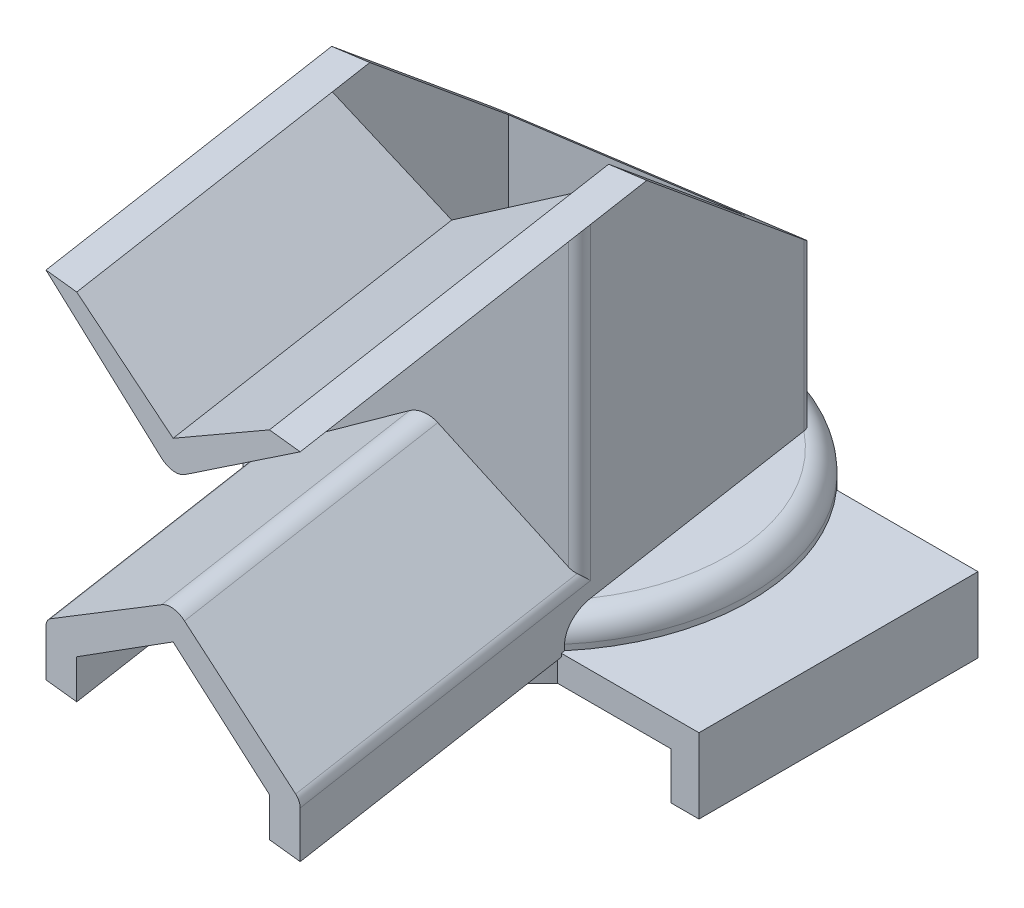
ISO-10303-21;
HEADER;
FILE_DESCRIPTION(('STEP AP214'),'2;1');
FILE_NAME('part.step','',(''),(''),'','','');
FILE_SCHEMA(('AUTOMOTIVE_DESIGN { 1 0 10303 214 1 1 1 1 }'));
ENDSEC;
DATA;
#1=APPLICATION_CONTEXT('core data for automotive mechanical design processes');
#2=APPLICATION_PROTOCOL_DEFINITION('international standard','automotive_design',2000,#1);
#3=PRODUCT_CONTEXT('',#1,'mechanical');
#4=PRODUCT('Part','Part','',(#3));
#5=PRODUCT_RELATED_PRODUCT_CATEGORY('part','',(#4));
#6=PRODUCT_DEFINITION_FORMATION('','',#4);
#7=PRODUCT_DEFINITION_CONTEXT('part definition',#1,'design');
#8=PRODUCT_DEFINITION('design','',#6,#7);
#9=PRODUCT_DEFINITION_SHAPE('','',#8);
#10=(LENGTH_UNIT() NAMED_UNIT(*) SI_UNIT(.MILLI.,.METRE.));
#11=(NAMED_UNIT(*) PLANE_ANGLE_UNIT() SI_UNIT($,.RADIAN.));
#12=(NAMED_UNIT(*) SI_UNIT($,.STERADIAN.) SOLID_ANGLE_UNIT());
#13=UNCERTAINTY_MEASURE_WITH_UNIT(LENGTH_MEASURE(1.E-05),#10,'distance_accuracy_value','');
#14=(GEOMETRIC_REPRESENTATION_CONTEXT(3) GLOBAL_UNCERTAINTY_ASSIGNED_CONTEXT((#13)) GLOBAL_UNIT_ASSIGNED_CONTEXT((#10,
#11,#12)) REPRESENTATION_CONTEXT('',''));
#15=CARTESIAN_POINT('',(0.,0.,0.));
#16=DIRECTION('',(0.,0.,1.));
#17=DIRECTION('',(1.,0.,0.));
#18=AXIS2_PLACEMENT_3D('',#15,#16,#17);
#19=CARTESIAN_POINT('',(0.,3.7,0.));
#20=DIRECTION('',(0.,-1.,0.));
#21=DIRECTION('',(0.,0.,-1.));
#22=AXIS2_PLACEMENT_3D('',#19,#20,#21);
#23=CYLINDRICAL_SURFACE('',#22,3.4);
#24=CARTESIAN_POINT('',(0.,9.7,0.));
#25=DIRECTION('',(0.,1.,0.));
#26=DIRECTION('',(0.,0.,1.));
#27=AXIS2_PLACEMENT_3D('',#24,#25,#26);
#28=CIRCLE('',#27,3.4);
#29=CARTESIAN_POINT('',(0.,9.7,3.4));
#30=VERTEX_POINT('',#29);
#31=EDGE_CURVE('E404',#30,#30,#28,.T.);
#32=ORIENTED_EDGE('',*,*,#31,.T.);
#33=EDGE_LOOP('',(#32));
#34=FACE_BOUND('',#33,.T.);
#35=CARTESIAN_POINT('',(0.,3.,0.));
#36=DIRECTION('',(0.,-1.,0.));
#37=DIRECTION('',(0.,0.,-1.));
#38=AXIS2_PLACEMENT_3D('',#35,#36,#37);
#39=CIRCLE('',#38,3.4);
#40=CARTESIAN_POINT('',(0.,3.,-3.4));
#41=VERTEX_POINT('',#40);
#42=EDGE_CURVE('E696',#41,#41,#39,.T.);
#43=ORIENTED_EDGE('',*,*,#42,.T.);
#44=EDGE_LOOP('',(#43));
#45=FACE_BOUND('',#44,.T.);
#46=ADVANCED_FACE('F33',(#34,#45),#23,.F.);
#47=CARTESIAN_POINT('',(0.,8.7,0.));
#48=DIRECTION('',(0.,1.,0.));
#49=DIRECTION('',(0.,0.,1.));
#50=AXIS2_PLACEMENT_3D('',#47,#48,#49);
#51=PLANE('',#50);
#52=DIRECTION('',(-0.149535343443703,0.,-0.988756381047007));
#53=VECTOR('',#52,1.);
#54=CARTESIAN_POINT('',(14.1148173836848,8.7,10.406340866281));
#55=LINE('',#54,#53);
#56=CARTESIAN_POINT('',(13.9621894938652,8.7,9.39713597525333));
#57=VERTEX_POINT('',#56);
#58=CARTESIAN_POINT('',(10.5589687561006,8.7,-13.1056124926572));
#59=VERTEX_POINT('',#58);
#60=EDGE_CURVE('E348',#57,#59,#55,.T.);
#61=ORIENTED_EDGE('',*,*,#60,.F.);
#62=CARTESIAN_POINT('',(0.,8.7,0.));
#63=DIRECTION('',(0.,1.,0.));
#64=DIRECTION('',(0.,0.,1.));
#65=AXIS2_PLACEMENT_3D('',#62,#63,#64);
#66=CIRCLE('',#65,16.83);
#67=EDGE_CURVE('E424',#57,#59,#66,.T.);
#68=ORIENTED_EDGE('',*,*,#67,.T.);
#69=EDGE_LOOP('',(#61,#68));
#70=FACE_BOUND('',#69,.T.);
#71=ADVANCED_FACE('F829',(#70),#51,.T.);
#72=DIRECTION('',(-0.988756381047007,0.,0.149535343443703));
#73=VECTOR('',#72,1.);
#74=CARTESIAN_POINT('',(10.406340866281,8.7,-14.1148173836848));
#75=LINE('',#74,#73);
#76=CARTESIAN_POINT('',(9.39713597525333,8.7,-13.9621894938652));
#77=VERTEX_POINT('',#76);
#78=CARTESIAN_POINT('',(-13.1056124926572,8.7,-10.5589687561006));
#79=VERTEX_POINT('',#78);
#80=EDGE_CURVE('E352',#77,#79,#75,.T.);
#81=ORIENTED_EDGE('',*,*,#80,.F.);
#82=CARTESIAN_POINT('',(0.,8.7,0.));
#83=DIRECTION('',(0.,1.,0.));
#84=DIRECTION('',(0.,0.,1.));
#85=AXIS2_PLACEMENT_3D('',#82,#83,#84);
#86=CIRCLE('',#85,16.83);
#87=EDGE_CURVE('E422',#77,#79,#86,.T.);
#88=ORIENTED_EDGE('',*,*,#87,.T.);
#89=EDGE_LOOP('',(#81,#88));
#90=FACE_BOUND('',#89,.T.);
#91=ADVANCED_FACE('F835',(#90),#51,.T.);
#92=CARTESIAN_POINT('',(-5.92028056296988,5.89999999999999,43.777508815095));
#93=DIRECTION('',(0.,1.,0.));
#94=DIRECTION('',(0.,0.,1.));
#95=AXIS2_PLACEMENT_3D('',#92,#93,#94);
#96=PLANE('',#95);
#97=DIRECTION('',(-0.149535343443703,0.,-0.988756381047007));
#98=VECTOR('',#97,1.);
#99=CARTESIAN_POINT('',(18.6008776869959,5.89999999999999,40.0690322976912));
#100=LINE('',#99,#98);
#101=CARTESIAN_POINT('',(18.6008776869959,5.89999999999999,40.0690322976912));
#102=VERTEX_POINT('',#101);
#103=CARTESIAN_POINT('',(14.4314535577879,5.89999999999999,12.5));
#104=VERTEX_POINT('',#103);
#105=EDGE_CURVE('E557',#102,#104,#100,.T.);
#106=ORIENTED_EDGE('',*,*,#105,.F.);
#107=DIRECTION('',(-0.994362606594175,0.,-0.106033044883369));
#108=VECTOR('',#107,1.);
#109=CARTESIAN_POINT('',(-5.25358470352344,5.89999999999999,37.5253311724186));
#110=LINE('',#109,#108);
#111=CARTESIAN_POINT('',(15.5170303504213,5.89999999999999,39.7401887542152));
#112=VERTEX_POINT('',#111);
#113=EDGE_CURVE('E555',#102,#112,#110,.T.);
#114=ORIENTED_EDGE('',*,*,#113,.T.);
#115=DIRECTION('',(0.149535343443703,0.,0.988756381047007));
#116=VECTOR('',#115,1.);
#117=CARTESIAN_POINT('',(11.8962249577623,5.89999999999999,15.7987288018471));
#118=LINE('',#117,#116);
#119=CARTESIAN_POINT('',(11.8962249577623,5.89999999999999,15.7987288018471));
#120=VERTEX_POINT('',#119);
#121=EDGE_CURVE('E655',#120,#112,#118,.T.);
#122=ORIENTED_EDGE('',*,*,#121,.F.);
#123=DIRECTION('',(0.988756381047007,0.,-0.149535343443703));
#124=VECTOR('',#123,1.);
#125=CARTESIAN_POINT('',(11.8962249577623,5.89999999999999,15.7987288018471));
#126=LINE('',#125,#124);
#127=CARTESIAN_POINT('',(9.71882515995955,5.89999999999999,16.128029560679));
#128=VERTEX_POINT('',#127);
#129=EDGE_CURVE('E672',#128,#120,#126,.T.);
#130=ORIENTED_EDGE('',*,*,#129,.F.);
#131=CARTESIAN_POINT('',(0.,5.89999999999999,0.));
#132=DIRECTION('',(0.,1.,0.));
#133=DIRECTION('',(0.,0.,1.));
#134=AXIS2_PLACEMENT_3D('',#131,#132,#133);
#135=CIRCLE('',#134,18.83);
#136=CARTESIAN_POINT('',(14.082574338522,5.89999999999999,12.5));
#137=VERTEX_POINT('',#136);
#138=EDGE_CURVE('E574',#128,#137,#135,.T.);
#139=ORIENTED_EDGE('',*,*,#138,.T.);
#140=DIRECTION('',(-1.,0.,0.));
#141=VECTOR('',#140,1.);
#142=CARTESIAN_POINT('',(10.761409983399,5.89999999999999,12.5));
#143=LINE('',#142,#141);
#144=EDGE_CURVE('E411',#104,#137,#143,.T.);
#145=ORIENTED_EDGE('',*,*,#144,.F.);
#146=EDGE_LOOP('',(#106,#114,#122,#130,#139,#145));
#147=FACE_BOUND('',#146,.T.);
#148=ADVANCED_FACE('F869',(#147),#96,.F.);
#149=CARTESIAN_POINT('',(-10.406340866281,37.7,14.1148173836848));
#150=DIRECTION('',(0.988756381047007,0.,-0.149535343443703));
#151=DIRECTION('',(-0.149535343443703,0.,-0.988756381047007));
#152=AXIS2_PLACEMENT_3D('',#149,#150,#151);
#153=PLANE('',#152);
#154=DIRECTION('',(0.,1.,0.));
#155=VECTOR('',#154,1.);
#156=CARTESIAN_POINT('',(-6.89226029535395,-0.5,37.3505923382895));
#157=LINE('',#156,#155);
#158=CARTESIAN_POINT('',(-6.89226029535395,5.89999999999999,37.3505923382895));
#159=VERTEX_POINT('',#158);
#160=CARTESIAN_POINT('',(-6.89226029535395,10.0660112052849,37.3505923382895));
#161=VERTEX_POINT('',#160);
#162=EDGE_CURVE('E326',#159,#161,#157,.T.);
#163=ORIENTED_EDGE('',*,*,#162,.T.);
#164=DIRECTION('',(0.149535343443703,0.,0.988756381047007));
#165=VECTOR('',#164,1.);
#166=CARTESIAN_POINT('',(-10.406340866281,10.0660112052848,14.1148173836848));
#167=LINE('',#166,#165);
#168=CARTESIAN_POINT('',(-10.5558762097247,10.0660112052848,13.1260610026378));
#169=VERTEX_POINT('',#168);
#170=EDGE_CURVE('E536',#161,#169,#167,.F.);
#171=ORIENTED_EDGE('',*,*,#170,.T.);
#172=DIRECTION('',(0.,-1.,0.));
#173=VECTOR('',#172,1.);
#174=CARTESIAN_POINT('',(-10.5558762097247,37.7,13.1260610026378));
#175=LINE('',#174,#173);
#176=CARTESIAN_POINT('',(-10.5558762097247,37.7,13.1260610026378));
#177=VERTEX_POINT('',#176);
#178=EDGE_CURVE('E47',#169,#177,#175,.F.);
#179=ORIENTED_EDGE('',*,*,#178,.T.);
#180=DIRECTION('',(0.149535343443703,0.,0.988756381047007));
#181=VECTOR('',#180,1.);
#182=CARTESIAN_POINT('',(-10.406340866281,37.7,14.1148173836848));
#183=LINE('',#182,#181);
#184=CARTESIAN_POINT('',(-11.4530882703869,37.7,7.19352271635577));
#185=VERTEX_POINT('',#184);
#186=EDGE_CURVE('E341',#185,#177,#183,.T.);
#187=ORIENTED_EDGE('',*,*,#186,.F.);
#188=DIRECTION('',(-0.114347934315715,-0.64440029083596,-0.756090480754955));
#189=VECTOR('',#188,1.);
#190=CARTESIAN_POINT('',(-10.8410045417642,41.1493577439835,11.2407377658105));
#191=LINE('',#190,#189);
#192=CARTESIAN_POINT('',(-13.9652820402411,23.5426966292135,-9.41758448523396));
#193=VERTEX_POINT('',#192);
#194=EDGE_CURVE('E679',#185,#193,#191,.T.);
#195=ORIENTED_EDGE('',*,*,#194,.T.);
#196=DIRECTION('',(0.,-1.,0.));
#197=VECTOR('',#196,1.);
#198=CARTESIAN_POINT('',(-13.9652820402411,37.7,-9.41758448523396));
#199=LINE('',#198,#197);
#200=CARTESIAN_POINT('',(-13.9652820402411,8.69995106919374,-9.41758448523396));
#201=VERTEX_POINT('',#200);
#202=EDGE_CURVE('E770',#193,#201,#199,.T.);
#203=ORIENTED_EDGE('',*,*,#202,.T.);
#204=CARTESIAN_POINT('',(-14.1148173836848,8.5711529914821,-10.406340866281));
#205=CARTESIAN_POINT('',(-14.1023651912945,8.59336871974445,-10.3240045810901));
#206=CARTESIAN_POINT('',(-14.0897953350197,8.61252612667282,-10.2408902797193));
#207=CARTESIAN_POINT('',(-14.0645409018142,8.64494568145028,-10.0739031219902));
#208=CARTESIAN_POINT('',(-14.0518570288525,8.6582322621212,-9.99003492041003));
#209=CARTESIAN_POINT('',(-14.0263931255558,8.67931019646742,-9.82166270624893));
#210=CARTESIAN_POINT('',(-14.0136131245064,8.6871031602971,-9.73715888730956));
#211=CARTESIAN_POINT('',(-13.9879513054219,8.69745595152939,-9.56747801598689));
#212=CARTESIAN_POINT('',(-13.9750692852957,8.69999356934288,-9.4822996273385));
#213=CARTESIAN_POINT('',(-13.9621894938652,8.7,-9.39713597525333));
#214=B_SPLINE_CURVE_WITH_KNOTS('',3,(#204,#205,#206,#207,#208,#209,#210,#211,#212,#213),
.UNSPECIFIED.,.F.,.F.,(4,2,2,2,4),(0.,0.258456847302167,0.515827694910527,0.773123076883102,
1.03150361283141),.UNSPECIFIED.);
#215=CARTESIAN_POINT('',(-13.9621894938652,8.7,-9.39713597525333));
#216=VERTEX_POINT('',#215);
#217=EDGE_CURVE('E470',#201,#216,#214,.T.);
#218=ORIENTED_EDGE('',*,*,#217,.T.);
#219=DIRECTION('',(0.149535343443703,0.,0.988756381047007));
#220=VECTOR('',#219,1.);
#221=CARTESIAN_POINT('',(-10.406340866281,8.7,14.1148173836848));
#222=LINE('',#221,#220);
#223=CARTESIAN_POINT('',(-10.5589687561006,8.7,13.1056124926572));
#224=VERTEX_POINT('',#223);
#225=EDGE_CURVE('E345',#216,#224,#222,.T.);
#226=ORIENTED_EDGE('',*,*,#225,.T.);
#227=CARTESIAN_POINT('',(-10.5589687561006,8.7,13.1056124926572));
#228=CARTESIAN_POINT('',(-10.5424076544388,8.6999811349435,13.2151176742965));
#229=CARTESIAN_POINT('',(-10.5258394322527,8.69579204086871,13.3246699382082));
#230=CARTESIAN_POINT('',(-10.4927678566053,8.67851525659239,13.5433455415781));
#231=CARTESIAN_POINT('',(-10.4762647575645,8.66540603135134,13.6524671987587));
#232=CARTESIAN_POINT('',(-10.4432993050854,8.62952469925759,13.8704410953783));
#233=CARTESIAN_POINT('',(-10.4268395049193,8.60664540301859,13.9792764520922));
#234=CARTESIAN_POINT('',(-10.3943349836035,8.55056483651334,14.1942025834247));
#235=CARTESIAN_POINT('',(-10.3782898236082,8.51737500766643,14.3002962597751));
#236=CARTESIAN_POINT('',(-10.342681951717,8.42979303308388,14.5357423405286));
#237=CARTESIAN_POINT('',(-10.3232946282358,8.37212764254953,14.6639350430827));
#238=CARTESIAN_POINT('',(-10.2861038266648,8.23789353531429,14.9098477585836));
#239=CARTESIAN_POINT('',(-10.2682945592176,8.16139816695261,15.0276060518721));
#240=CARTESIAN_POINT('',(-10.2383704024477,8.00606009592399,15.2254703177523));
#241=CARTESIAN_POINT('',(-10.2258343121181,7.93086471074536,15.3083613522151));
#242=CARTESIAN_POINT('',(-10.2027349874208,7.76782188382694,15.4610985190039));
#243=CARTESIAN_POINT('',(-10.1921705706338,7.67998208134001,15.5309524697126));
#244=CARTESIAN_POINT('',(-10.1752285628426,7.50902227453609,15.6429762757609));
#245=CARTESIAN_POINT('',(-10.1684428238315,7.42771516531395,15.6878448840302));
#246=CARTESIAN_POINT('',(-10.1569918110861,7.25873227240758,15.7635611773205));
#247=CARTESIAN_POINT('',(-10.1523226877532,7.17106838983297,15.7944343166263));
#248=CARTESIAN_POINT('',(-10.1464519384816,7.01920564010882,15.8332528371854));
#249=CARTESIAN_POINT('',(-10.1446258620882,6.95606468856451,15.8453272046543));
#250=CARTESIAN_POINT('',(-10.1421747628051,6.82863459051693,15.8615343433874));
#251=CARTESIAN_POINT('',(-10.1415519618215,6.76434354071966,15.8656524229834));
#252=CARTESIAN_POINT('',(-10.1415577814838,6.7,15.8656139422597));
#253=B_SPLINE_CURVE_WITH_KNOTS('',3,(#227,#228,#229,#230,#231,#232,#233,#234,#235,#236,#237,
#238,#239,#240,#241,#242,#243,#244,#245,#246,#247,#248,#249,#250,#251,#252),.UNSPECIFIED.,.F.,
.F.,(4,2,2,2,2,2,2,2,2,2,2,2,4),(0.,0.332243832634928,0.665292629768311,1.00209324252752,
1.33852144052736,1.76278904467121,2.1854294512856,2.52203994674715,2.85844792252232,
3.13665125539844,3.41434655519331,3.60679450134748,3.79959747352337),.UNSPECIFIED.);
#254=CARTESIAN_POINT('',(-10.1415577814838,6.7,15.8656139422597));
#255=VERTEX_POINT('',#254);
#256=EDGE_CURVE('E477',#224,#255,#253,.T.);
#257=ORIENTED_EDGE('',*,*,#256,.T.);
#258=DIRECTION('',(0.,-1.,0.));
#259=VECTOR('',#258,1.);
#260=CARTESIAN_POINT('',(-10.1415577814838,8.7,15.8656139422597));
#261=LINE('',#260,#259);
#262=CARTESIAN_POINT('',(-10.1415577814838,5.89999999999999,15.8656139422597));
#263=VERTEX_POINT('',#262);
#264=EDGE_CURVE('E414',#255,#263,#261,.T.);
#265=ORIENTED_EDGE('',*,*,#264,.T.);
#266=DIRECTION('',(-0.149535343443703,0.,-0.988756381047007));
#267=VECTOR('',#266,1.);
#268=CARTESIAN_POINT('',(-5.92028056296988,5.89999999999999,43.777508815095));
#269=LINE('',#268,#267);
#270=EDGE_CURVE('E560',#159,#263,#269,.T.);
#271=ORIENTED_EDGE('',*,*,#270,.F.);
#272=EDGE_LOOP('',(#163,#171,#179,#187,#195,#203,#218,#226,#257,#265,#271));
#273=FACE_BOUND('',#272,.T.);
#274=ADVANCED_FACE('F728',(#273),#153,.F.);
#275=CARTESIAN_POINT('',(0.,37.7,0.));
#276=DIRECTION('',(0.,1.,0.));
#277=DIRECTION('',(0.,0.,1.));
#278=AXIS2_PLACEMENT_3D('',#275,#276,#277);
#279=PLANE('',#278);
#280=DIRECTION('',(-0.994362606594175,0.,-0.106033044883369));
#281=VECTOR('',#280,1.);
#282=CARTESIAN_POINT('',(-6.89226029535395,37.7,37.3505923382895));
#283=LINE('',#282,#281);
#284=CARTESIAN_POINT('',(18.6008776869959,37.7,40.0690322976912));
#285=VERTEX_POINT('',#284);
#286=CARTESIAN_POINT('',(15.5170303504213,37.7,39.7401887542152));
#287=VERTEX_POINT('',#286);
#288=EDGE_CURVE('E309',#285,#287,#283,.T.);
#289=ORIENTED_EDGE('',*,*,#288,.F.);
#290=DIRECTION('',(-0.149535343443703,0.,-0.988756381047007));
#291=VECTOR('',#290,1.);
#292=CARTESIAN_POINT('',(14.1148173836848,37.7,10.406340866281));
#293=LINE('',#292,#291);
#294=CARTESIAN_POINT('',(13.9652820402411,37.7,9.41758448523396));
#295=VERTEX_POINT('',#294);
#296=EDGE_CURVE('E322',#285,#295,#293,.T.);
#297=ORIENTED_EDGE('',*,*,#296,.T.);
#298=CARTESIAN_POINT('',(13.0680699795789,37.7,3.48504619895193));
#299=VERTEX_POINT('',#298);
#300=EDGE_CURVE('E336',#295,#299,#293,.T.);
#301=ORIENTED_EDGE('',*,*,#300,.T.);
#302=DIRECTION('',(0.988756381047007,0.,-0.149535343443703));
#303=VECTOR('',#302,1.);
#304=CARTESIAN_POINT('',(-24.0741358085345,37.7,9.10227669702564));
#305=LINE('',#304,#303);
#306=CARTESIAN_POINT('',(10.1018008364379,37.7,3.93365222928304));
#307=VERTEX_POINT('',#306);
#308=EDGE_CURVE('E687',#307,#299,#305,.T.);
#309=ORIENTED_EDGE('',*,*,#308,.F.);
#310=DIRECTION('',(-0.149535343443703,0.,-0.988756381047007));
#311=VECTOR('',#310,1.);
#312=CARTESIAN_POINT('',(10.6999422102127,37.7,7.88867775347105));
#313=LINE('',#312,#311);
#314=CARTESIAN_POINT('',(10.6999422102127,37.7,7.88867775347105));
#315=VERTEX_POINT('',#314);
#316=EDGE_CURVE('E581',#315,#307,#313,.T.);
#317=ORIENTED_EDGE('',*,*,#316,.F.);
#318=DIRECTION('',(0.149535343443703,0.,0.988756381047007));
#319=VECTOR('',#318,1.);
#320=CARTESIAN_POINT('',(6.08916447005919,37.7,-22.5986692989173));
#321=LINE('',#320,#319);
#322=EDGE_CURVE('E325',#315,#287,#321,.T.);
#323=ORIENTED_EDGE('',*,*,#322,.T.);
#324=EDGE_LOOP('',(#289,#297,#301,#309,#317,#323));
#325=FACE_BOUND('',#324,.T.);
#326=ADVANCED_FACE('F321',(#325),#279,.T.);
#327=CARTESIAN_POINT('',(14.1148173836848,37.7,10.406340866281));
#328=DIRECTION('',(-0.149535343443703,0.,-0.988756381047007));
#329=DIRECTION('',(-0.988756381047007,0.,0.149535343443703));
#330=AXIS2_PLACEMENT_3D('',#327,#328,#329);
#331=PLANE('',#330);
#332=DIRECTION('',(0.821674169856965,-0.556245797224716,-0.124266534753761));
#333=VECTOR('',#332,1.);
#334=CARTESIAN_POINT('',(14.1148173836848,10.6,10.406340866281));
#335=LINE('',#334,#333);
#336=CARTESIAN_POINT('',(2.95422142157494,18.1553483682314,12.0942223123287));
#337=VERTEX_POINT('',#336);
#338=CARTESIAN_POINT('',(13.1260610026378,11.2693548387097,10.5558762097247));
#339=VERTEX_POINT('',#338);
#340=EDGE_CURVE('E639',#337,#339,#335,.T.);
#341=ORIENTED_EDGE('',*,*,#340,.T.);
#342=DIRECTION('',(0.,-1.,0.));
#343=VECTOR('',#342,1.);
#344=CARTESIAN_POINT('',(13.1260610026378,37.7,10.5558762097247));
#345=LINE('',#344,#343);
#346=CARTESIAN_POINT('',(13.1260610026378,36.9741935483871,10.5558762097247));
#347=VERTEX_POINT('',#346);
#348=EDGE_CURVE('E769',#339,#347,#345,.F.);
#349=ORIENTED_EDGE('',*,*,#348,.T.);
#350=DIRECTION('',(-0.800200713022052,-0.587395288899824,0.121018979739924));
#351=VECTOR('',#350,1.);
#352=CARTESIAN_POINT('',(1.85423825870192,28.7,12.2605791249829));
#353=LINE('',#352,#351);
#354=CARTESIAN_POINT('',(3.01581993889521,29.552670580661,12.0849064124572));
#355=VERTEX_POINT('',#354);
#356=EDGE_CURVE('E630',#347,#355,#353,.T.);
#357=ORIENTED_EDGE('',*,*,#356,.T.);
#358=CARTESIAN_POINT('',(1.85423825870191,31.1712709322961,12.2605791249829));
#359=DIRECTION('',(-0.149535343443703,0.,-0.988756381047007));
#360=DIRECTION('',(-0.988756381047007,0.,0.149535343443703));
#361=AXIS2_PLACEMENT_3D('',#358,#359,#360);
#362=CIRCLE('',#361,2.);
#363=CARTESIAN_POINT('',(0.692656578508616,29.552670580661,12.4362518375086));
#364=VERTEX_POINT('',#363);
#365=EDGE_CURVE('E748',#355,#364,#362,.T.);
#366=ORIENTED_EDGE('',*,*,#365,.T.);
#367=DIRECTION('',(-0.800200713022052,0.587395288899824,0.121018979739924));
#368=VECTOR('',#367,1.);
#369=CARTESIAN_POINT('',(-10.406340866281,37.7,14.1148173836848));
#370=LINE('',#369,#368);
#371=CARTESIAN_POINT('',(-9.41758448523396,36.9741935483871,13.9652820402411));
#372=VERTEX_POINT('',#371);
#373=EDGE_CURVE('E636',#364,#372,#370,.T.);
#374=ORIENTED_EDGE('',*,*,#373,.T.);
#375=DIRECTION('',(0.,-1.,0.));
#376=VECTOR('',#375,1.);
#377=CARTESIAN_POINT('',(-9.41758448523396,37.7,13.9652820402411));
#378=LINE('',#377,#376);
#379=CARTESIAN_POINT('',(-9.41758448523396,11.2693548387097,13.9652820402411));
#380=VERTEX_POINT('',#379);
#381=EDGE_CURVE('E766',#372,#380,#378,.T.);
#382=ORIENTED_EDGE('',*,*,#381,.T.);
#383=DIRECTION('',(0.821674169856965,0.556245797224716,-0.124266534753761));
#384=VECTOR('',#383,1.);
#385=CARTESIAN_POINT('',(-10.406340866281,10.6,14.1148173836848));
#386=LINE('',#385,#384);
#387=CARTESIAN_POINT('',(0.754255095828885,18.1553483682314,12.4269359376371));
#388=VERTEX_POINT('',#387);
#389=EDGE_CURVE('E642',#380,#388,#386,.T.);
#390=ORIENTED_EDGE('',*,*,#389,.T.);
#391=CARTESIAN_POINT('',(1.85423825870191,16.4933127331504,12.2605791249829));
#392=DIRECTION('',(-0.149535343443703,0.,-0.988756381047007));
#393=DIRECTION('',(-0.988756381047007,0.,0.149535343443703));
#394=AXIS2_PLACEMENT_3D('',#391,#392,#393);
#395=CIRCLE('',#394,2.);
#396=EDGE_CURVE('E747',#388,#337,#395,.T.);
#397=ORIENTED_EDGE('',*,*,#396,.T.);
#398=EDGE_LOOP('',(#341,#349,#357,#366,#374,#382,#390,#397));
#399=FACE_BOUND('',#398,.T.);
#400=ADVANCED_FACE('F783',(#399),#331,.F.);
#401=ORIENTED_EDGE('',*,*,#225,.F.);
#402=CARTESIAN_POINT('',(0.,8.7,0.));
#403=DIRECTION('',(0.,1.,0.));
#404=DIRECTION('',(0.,0.,1.));
#405=AXIS2_PLACEMENT_3D('',#402,#403,#404);
#406=CIRCLE('',#405,16.83);
#407=EDGE_CURVE('E420',#216,#224,#406,.T.);
#408=ORIENTED_EDGE('',*,*,#407,.T.);
#409=EDGE_LOOP('',(#401,#408));
#410=FACE_BOUND('',#409,.T.);
#411=ADVANCED_FACE('F838',(#410),#51,.T.);
#412=CARTESIAN_POINT('',(0.,8.7,0.));
#413=DIRECTION('',(0.,-1.,0.));
#414=DIRECTION('',(0.,0.,-1.));
#415=AXIS2_PLACEMENT_3D('',#412,#413,#414);
#416=CYLINDRICAL_SURFACE('',#415,18.83);
#417=ORIENTED_EDGE('',*,*,#264,.F.);
#418=CARTESIAN_POINT('',(0.,6.7,0.));
#419=DIRECTION('',(0.,1.,0.));
#420=DIRECTION('',(0.,0.,1.));
#421=AXIS2_PLACEMENT_3D('',#418,#419,#420);
#422=CIRCLE('',#421,18.83);
#423=CARTESIAN_POINT('',(14.379600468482,6.7,12.1571374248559));
#424=VERTEX_POINT('',#423);
#425=EDGE_CURVE('E427',#255,#424,#422,.F.);
#426=ORIENTED_EDGE('',*,*,#425,.T.);
#427=DIRECTION('',(0.,-1.,0.));
#428=VECTOR('',#427,1.);
#429=CARTESIAN_POINT('',(14.379600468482,8.7,12.1571374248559));
#430=LINE('',#429,#428);
#431=CARTESIAN_POINT('',(14.379600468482,6.2,12.1571374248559));
#432=VERTEX_POINT('',#431);
#433=EDGE_CURVE('E571',#432,#424,#430,.F.);
#434=ORIENTED_EDGE('',*,*,#433,.F.);
#435=CARTESIAN_POINT('',(0.,6.2,0.));
#436=DIRECTION('',(0.,1.,0.));
#437=DIRECTION('',(0.,0.,1.));
#438=AXIS2_PLACEMENT_3D('',#435,#436,#437);
#439=CIRCLE('',#438,18.83);
#440=CARTESIAN_POINT('',(14.0825743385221,6.2,-12.5));
#441=VERTEX_POINT('',#440);
#442=EDGE_CURVE('E399',#432,#441,#439,.T.);
#443=ORIENTED_EDGE('',*,*,#442,.T.);
#444=DIRECTION('',(0.,-1.,0.));
#445=VECTOR('',#444,1.);
#446=CARTESIAN_POINT('',(14.0825743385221,8.7,-12.5));
#447=LINE('',#446,#445);
#448=CARTESIAN_POINT('',(14.0825743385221,3.7,-12.5));
#449=VERTEX_POINT('',#448);
#450=EDGE_CURVE('E389',#441,#449,#447,.T.);
#451=ORIENTED_EDGE('',*,*,#450,.T.);
#452=CARTESIAN_POINT('',(0.,3.7,0.));
#453=DIRECTION('',(0.,1.,0.));
#454=DIRECTION('',(0.,0.,1.));
#455=AXIS2_PLACEMENT_3D('',#452,#453,#454);
#456=CIRCLE('',#455,18.83);
#457=CARTESIAN_POINT('',(14.082574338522,3.7,12.5));
#458=VERTEX_POINT('',#457);
#459=EDGE_CURVE('E392',#449,#458,#456,.T.);
#460=ORIENTED_EDGE('',*,*,#459,.T.);
#461=DIRECTION('',(0.,-1.,0.));
#462=VECTOR('',#461,1.);
#463=CARTESIAN_POINT('',(14.082574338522,8.7,12.5));
#464=LINE('',#463,#462);
#465=EDGE_CURVE('E385',#458,#137,#464,.F.);
#466=ORIENTED_EDGE('',*,*,#465,.T.);
#467=ORIENTED_EDGE('',*,*,#138,.F.);
#468=CARTESIAN_POINT('',(0.,5.89999999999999,0.));
#469=DIRECTION('',(0.,-1.,0.));
#470=DIRECTION('',(1.,0.,0.));
#471=AXIS2_PLACEMENT_3D('',#468,#469,#470);
#472=CIRCLE('',#471,18.83);
#473=CARTESIAN_POINT('',(-4.5149952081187,5.89999999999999,18.2806924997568));
#474=VERTEX_POINT('',#473);
#475=EDGE_CURVE('E644',#128,#474,#472,.T.);
#476=ORIENTED_EDGE('',*,*,#475,.T.);
#477=EDGE_CURVE('E408',#263,#474,#135,.T.);
#478=ORIENTED_EDGE('',*,*,#477,.F.);
#479=EDGE_LOOP('',(#417,#426,#434,#443,#451,#460,#466,#467,#476,#478));
#480=FACE_BOUND('',#479,.T.);
#481=ADVANCED_FACE('F840',(#480),#416,.T.);
#482=CARTESIAN_POINT('',(10.761409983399,6.2,12.5));
#483=DIRECTION('',(0.,0.,1.));
#484=DIRECTION('',(1.,0.,0.));
#485=AXIS2_PLACEMENT_3D('',#482,#483,#484);
#486=PLANE('',#485);
#487=DIRECTION('',(0.,-1.,0.));
#488=VECTOR('',#487,1.);
#489=CARTESIAN_POINT('',(14.4314535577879,6.2,12.5));
#490=LINE('',#489,#488);
#491=CARTESIAN_POINT('',(14.4314535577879,6.2,12.5));
#492=VERTEX_POINT('',#491);
#493=EDGE_CURVE('E568',#492,#104,#490,.T.);
#494=ORIENTED_EDGE('',*,*,#493,.T.);
#495=ORIENTED_EDGE('',*,*,#144,.T.);
#496=ORIENTED_EDGE('',*,*,#465,.F.);
#497=DIRECTION('',(-1.,0.,0.));
#498=VECTOR('',#497,1.);
#499=CARTESIAN_POINT('',(10.761409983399,3.7,12.5));
#500=LINE('',#499,#498);
#501=CARTESIAN_POINT('',(24.261409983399,3.7,12.5));
#502=VERTEX_POINT('',#501);
#503=EDGE_CURVE('E370',#502,#458,#500,.T.);
#504=ORIENTED_EDGE('',*,*,#503,.F.);
#505=DIRECTION('',(0.,1.,0.));
#506=VECTOR('',#505,1.);
#507=CARTESIAN_POINT('',(24.261409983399,-0.5,12.5));
#508=LINE('',#507,#506);
#509=CARTESIAN_POINT('',(24.261409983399,-0.5,12.5));
#510=VERTEX_POINT('',#509);
#511=EDGE_CURVE('E367',#510,#502,#508,.T.);
#512=ORIENTED_EDGE('',*,*,#511,.F.);
#513=DIRECTION('',(-1.,0.,0.));
#514=VECTOR('',#513,1.);
#515=CARTESIAN_POINT('',(26.761409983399,-0.5,12.5));
#516=LINE('',#515,#514);
#517=CARTESIAN_POINT('',(26.761409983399,-0.5,12.5));
#518=VERTEX_POINT('',#517);
#519=EDGE_CURVE('E357',#518,#510,#516,.T.);
#520=ORIENTED_EDGE('',*,*,#519,.F.);
#521=DIRECTION('',(0.,-1.,0.));
#522=VECTOR('',#521,1.);
#523=CARTESIAN_POINT('',(26.761409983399,6.2,12.5));
#524=LINE('',#523,#522);
#525=CARTESIAN_POINT('',(26.761409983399,6.2,12.5));
#526=VERTEX_POINT('',#525);
#527=EDGE_CURVE('E380',#526,#518,#524,.T.);
#528=ORIENTED_EDGE('',*,*,#527,.F.);
#529=DIRECTION('',(-1.,0.,0.));
#530=VECTOR('',#529,1.);
#531=CARTESIAN_POINT('',(10.761409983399,6.2,12.5));
#532=LINE('',#531,#530);
#533=EDGE_CURVE('E374',#526,#492,#532,.T.);
#534=ORIENTED_EDGE('',*,*,#533,.T.);
#535=EDGE_LOOP('',(#494,#495,#496,#504,#512,#520,#528,#534));
#536=FACE_BOUND('',#535,.T.);
#537=ADVANCED_FACE('F843',(#536),#486,.T.);
#538=CARTESIAN_POINT('',(0.,6.2,0.));
#539=DIRECTION('',(0.,1.,0.));
#540=DIRECTION('',(0.,0.,1.));
#541=AXIS2_PLACEMENT_3D('',#538,#539,#540);
#542=PLANE('',#541);
#543=ORIENTED_EDGE('',*,*,#442,.F.);
#544=DIRECTION('',(0.149535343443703,0.,0.988756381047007));
#545=VECTOR('',#544,1.);
#546=CARTESIAN_POINT('',(12.2605791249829,6.2,-1.85423825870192));
#547=LINE('',#546,#545);
#548=EDGE_CURVE('E403',#432,#492,#547,.T.);
#549=ORIENTED_EDGE('',*,*,#548,.T.);
#550=ORIENTED_EDGE('',*,*,#533,.F.);
#551=DIRECTION('',(0.,0.,1.));
#552=VECTOR('',#551,1.);
#553=CARTESIAN_POINT('',(26.761409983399,6.2,-12.5));
#554=LINE('',#553,#552);
#555=CARTESIAN_POINT('',(26.761409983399,6.2,-12.5));
#556=VERTEX_POINT('',#555);
#557=EDGE_CURVE('E371',#556,#526,#554,.T.);
#558=ORIENTED_EDGE('',*,*,#557,.F.);
#559=DIRECTION('',(1.,0.,0.));
#560=VECTOR('',#559,1.);
#561=CARTESIAN_POINT('',(10.761409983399,6.2,-12.5));
#562=LINE('',#561,#560);
#563=EDGE_CURVE('E378',#441,#556,#562,.T.);
#564=ORIENTED_EDGE('',*,*,#563,.F.);
#565=EDGE_LOOP('',(#543,#549,#550,#558,#564));
#566=FACE_BOUND('',#565,.T.);
#567=ADVANCED_FACE('F846',(#566),#542,.T.);
#568=CARTESIAN_POINT('',(0.,3.7,0.));
#569=DIRECTION('',(0.,1.,0.));
#570=DIRECTION('',(0.,0.,1.));
#571=AXIS2_PLACEMENT_3D('',#568,#569,#570);
#572=PLANE('',#571);
#573=CARTESIAN_POINT('',(0.,3.7,0.));
#574=DIRECTION('',(0.,1.,0.));
#575=DIRECTION('',(0.,0.,1.));
#576=AXIS2_PLACEMENT_3D('',#573,#574,#575);
#577=CIRCLE('',#576,6.1);
#578=CARTESIAN_POINT('',(0.,3.7,6.1));
#579=VERTEX_POINT('',#578);
#580=EDGE_CURVE('E396',#579,#579,#577,.T.);
#581=ORIENTED_EDGE('',*,*,#580,.T.);
#582=EDGE_LOOP('',(#581));
#583=FACE_BOUND('',#582,.T.);
#584=DIRECTION('',(0.,0.,-1.));
#585=VECTOR('',#584,1.);
#586=CARTESIAN_POINT('',(24.261409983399,3.7,12.5));
#587=LINE('',#586,#585);
#588=CARTESIAN_POINT('',(24.261409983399,3.7,-12.5));
#589=VERTEX_POINT('',#588);
#590=EDGE_CURVE('E335',#502,#589,#587,.T.);
#591=ORIENTED_EDGE('',*,*,#590,.F.);
#592=ORIENTED_EDGE('',*,*,#503,.T.);
#593=ORIENTED_EDGE('',*,*,#459,.F.);
#594=DIRECTION('',(1.,0.,0.));
#595=VECTOR('',#594,1.);
#596=CARTESIAN_POINT('',(10.761409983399,3.7,-12.5));
#597=LINE('',#596,#595);
#598=EDGE_CURVE('E375',#449,#589,#597,.T.);
#599=ORIENTED_EDGE('',*,*,#598,.T.);
#600=EDGE_LOOP('',(#591,#592,#593,#599));
#601=FACE_BOUND('',#600,.T.);
#602=ADVANCED_FACE('F815',(#583,#601),#572,.F.);
#603=CARTESIAN_POINT('',(0.,0.,0.));
#604=DIRECTION('',(0.,1.,0.));
#605=DIRECTION('',(0.,0.,1.));
#606=AXIS2_PLACEMENT_3D('',#603,#604,#605);
#607=PLANE('',#606);
#608=CARTESIAN_POINT('',(0.,0.,0.));
#609=DIRECTION('',(0.,-1.,0.));
#610=DIRECTION('',(0.,0.,-1.));
#611=AXIS2_PLACEMENT_3D('',#608,#609,#610);
#612=CIRCLE('',#611,4.25);
#613=CARTESIAN_POINT('',(0.,0.,-4.25));
#614=VERTEX_POINT('',#613);
#615=EDGE_CURVE('E697',#614,#614,#612,.T.);
#616=ORIENTED_EDGE('',*,*,#615,.F.);
#617=EDGE_LOOP('',(#616));
#618=FACE_BOUND('',#617,.T.);
#619=CARTESIAN_POINT('',(0.,0.,0.));
#620=DIRECTION('',(0.,1.,0.));
#621=DIRECTION('',(0.,0.,1.));
#622=AXIS2_PLACEMENT_3D('',#619,#620,#621);
#623=CIRCLE('',#622,6.1);
#624=CARTESIAN_POINT('',(0.,0.,6.1));
#625=VERTEX_POINT('',#624);
#626=EDGE_CURVE('E395',#625,#625,#623,.T.);
#627=ORIENTED_EDGE('',*,*,#626,.F.);
#628=EDGE_LOOP('',(#627));
#629=FACE_BOUND('',#628,.T.);
#630=ADVANCED_FACE('F812',(#618,#629),#607,.F.);
#631=CARTESIAN_POINT('',(0.,3.7,0.));
#632=DIRECTION('',(0.,-1.,0.));
#633=DIRECTION('',(0.,0.,-1.));
#634=AXIS2_PLACEMENT_3D('',#631,#632,#633);
#635=CYLINDRICAL_SURFACE('',#634,6.1);
#636=ORIENTED_EDGE('',*,*,#580,.F.);
#637=EDGE_LOOP('',(#636));
#638=FACE_BOUND('',#637,.T.);
#639=ORIENTED_EDGE('',*,*,#626,.T.);
#640=EDGE_LOOP('',(#639));
#641=FACE_BOUND('',#640,.T.);
#642=ADVANCED_FACE('F454',(#638,#641),#635,.T.);
#643=CARTESIAN_POINT('',(10.761409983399,6.2,-12.5));
#644=DIRECTION('',(0.,0.,-1.));
#645=DIRECTION('',(-1.,0.,0.));
#646=AXIS2_PLACEMENT_3D('',#643,#644,#645);
#647=PLANE('',#646);
#648=ORIENTED_EDGE('',*,*,#450,.F.);
#649=ORIENTED_EDGE('',*,*,#563,.T.);
#650=DIRECTION('',(0.,-1.,0.));
#651=VECTOR('',#650,1.);
#652=CARTESIAN_POINT('',(26.761409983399,6.2,-12.5));
#653=LINE('',#652,#651);
#654=CARTESIAN_POINT('',(26.761409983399,-0.5,-12.5));
#655=VERTEX_POINT('',#654);
#656=EDGE_CURVE('E383',#556,#655,#653,.T.);
#657=ORIENTED_EDGE('',*,*,#656,.T.);
#658=DIRECTION('',(1.,0.,0.));
#659=VECTOR('',#658,1.);
#660=CARTESIAN_POINT('',(26.761409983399,-0.5,-12.5));
#661=LINE('',#660,#659);
#662=CARTESIAN_POINT('',(24.261409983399,-0.5,-12.5));
#663=VERTEX_POINT('',#662);
#664=EDGE_CURVE('E361',#663,#655,#661,.T.);
#665=ORIENTED_EDGE('',*,*,#664,.F.);
#666=DIRECTION('',(0.,1.,0.));
#667=VECTOR('',#666,1.);
#668=CARTESIAN_POINT('',(24.261409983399,-0.5,-12.5));
#669=LINE('',#668,#667);
#670=EDGE_CURVE('E363',#663,#589,#669,.T.);
#671=ORIENTED_EDGE('',*,*,#670,.T.);
#672=ORIENTED_EDGE('',*,*,#598,.F.);
#673=EDGE_LOOP('',(#648,#649,#657,#665,#671,#672));
#674=FACE_BOUND('',#673,.T.);
#675=ADVANCED_FACE('F819',(#674),#647,.T.);
#676=CARTESIAN_POINT('',(26.761409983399,6.2,-12.5));
#677=DIRECTION('',(1.,0.,0.));
#678=DIRECTION('',(0.,0.,-1.));
#679=AXIS2_PLACEMENT_3D('',#676,#677,#678);
#680=PLANE('',#679);
#681=ORIENTED_EDGE('',*,*,#527,.T.);
#682=DIRECTION('',(0.,0.,1.));
#683=VECTOR('',#682,1.);
#684=CARTESIAN_POINT('',(26.761409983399,-0.5,12.5));
#685=LINE('',#684,#683);
#686=EDGE_CURVE('E339',#655,#518,#685,.T.);
#687=ORIENTED_EDGE('',*,*,#686,.F.);
#688=ORIENTED_EDGE('',*,*,#656,.F.);
#689=ORIENTED_EDGE('',*,*,#557,.T.);
#690=EDGE_LOOP('',(#681,#687,#688,#689));
#691=FACE_BOUND('',#690,.T.);
#692=ADVANCED_FACE('F824',(#691),#680,.T.);
#693=CARTESIAN_POINT('',(24.261409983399,-0.5,12.5));
#694=DIRECTION('',(1.,0.,0.));
#695=DIRECTION('',(0.,0.,-1.));
#696=AXIS2_PLACEMENT_3D('',#693,#694,#695);
#697=PLANE('',#696);
#698=ORIENTED_EDGE('',*,*,#590,.T.);
#699=ORIENTED_EDGE('',*,*,#670,.F.);
#700=DIRECTION('',(0.,0.,-1.));
#701=VECTOR('',#700,1.);
#702=CARTESIAN_POINT('',(24.261409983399,-0.5,12.5));
#703=LINE('',#702,#701);
#704=EDGE_CURVE('E359',#510,#663,#703,.T.);
#705=ORIENTED_EDGE('',*,*,#704,.F.);
#706=ORIENTED_EDGE('',*,*,#511,.T.);
#707=EDGE_LOOP('',(#698,#699,#705,#706));
#708=FACE_BOUND('',#707,.T.);
#709=ADVANCED_FACE('F853',(#708),#697,.F.);
#710=CARTESIAN_POINT('',(0.,-0.5,0.));
#711=DIRECTION('',(0.,1.,0.));
#712=DIRECTION('',(0.,0.,1.));
#713=AXIS2_PLACEMENT_3D('',#710,#711,#712);
#714=PLANE('',#713);
#715=ORIENTED_EDGE('',*,*,#686,.T.);
#716=ORIENTED_EDGE('',*,*,#519,.T.);
#717=ORIENTED_EDGE('',*,*,#704,.T.);
#718=ORIENTED_EDGE('',*,*,#664,.T.);
#719=EDGE_LOOP('',(#715,#716,#717,#718));
#720=FACE_BOUND('',#719,.T.);
#721=ADVANCED_FACE('F863',(#720),#714,.F.);
#722=CARTESIAN_POINT('',(14.1148173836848,37.7,10.406340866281));
#723=DIRECTION('',(-0.988756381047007,0.,0.149535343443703));
#724=DIRECTION('',(0.149535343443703,0.,0.988756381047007));
#725=AXIS2_PLACEMENT_3D('',#722,#723,#724);
#726=PLANE('',#725);
#727=DIRECTION('',(0.,-1.,0.));
#728=VECTOR('',#727,1.);
#729=CARTESIAN_POINT('',(13.9652820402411,37.7,9.41758448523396));
#730=LINE('',#729,#728);
#731=CARTESIAN_POINT('',(13.9652820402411,10.0660112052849,9.41758448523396));
#732=VERTEX_POINT('',#731);
#733=EDGE_CURVE('E541',#295,#732,#730,.T.);
#734=ORIENTED_EDGE('',*,*,#733,.T.);
#735=DIRECTION('',(0.149535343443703,0.,0.988756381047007));
#736=VECTOR('',#735,1.);
#737=CARTESIAN_POINT('',(14.1148173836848,10.0660112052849,10.406340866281));
#738=LINE('',#737,#736);
#739=CARTESIAN_POINT('',(18.6008776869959,10.0660112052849,40.0690322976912));
#740=VERTEX_POINT('',#739);
#741=EDGE_CURVE('E522',#732,#740,#738,.T.);
#742=ORIENTED_EDGE('',*,*,#741,.T.);
#743=DIRECTION('',(0.,1.,0.));
#744=VECTOR('',#743,1.);
#745=CARTESIAN_POINT('',(18.6008776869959,18.9,40.0690322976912));
#746=LINE('',#745,#744);
#747=EDGE_CURVE('E549',#102,#740,#746,.T.);
#748=ORIENTED_EDGE('',*,*,#747,.F.);
#749=ORIENTED_EDGE('',*,*,#105,.T.);
#750=ORIENTED_EDGE('',*,*,#493,.F.);
#751=ORIENTED_EDGE('',*,*,#548,.F.);
#752=ORIENTED_EDGE('',*,*,#433,.T.);
#753=CARTESIAN_POINT('',(14.379600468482,6.7,12.1571374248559));
#754=CARTESIAN_POINT('',(14.3796023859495,6.74617135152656,12.1571501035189));
#755=CARTESIAN_POINT('',(14.3792828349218,6.79233602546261,12.1550371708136));
#756=CARTESIAN_POINT('',(14.378015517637,6.88425270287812,12.1466574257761));
#757=CARTESIAN_POINT('',(14.3770681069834,6.93000492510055,12.1403929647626));
#758=CARTESIAN_POINT('',(14.3745682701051,7.02044267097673,12.1238635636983));
#759=CARTESIAN_POINT('',(14.3730199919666,7.06513332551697,12.1136260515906));
#760=CARTESIAN_POINT('',(14.3693459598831,7.15343042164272,12.0893326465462));
#761=CARTESIAN_POINT('',(14.3672201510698,7.19703675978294,12.07527639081));
#762=CARTESIAN_POINT('',(14.3600330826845,7.32560917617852,12.0277541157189));
#763=CARTESIAN_POINT('',(14.35415468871,7.40859068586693,11.9888850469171));
#764=CARTESIAN_POINT('',(14.3405366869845,7.56744534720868,11.8988402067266));
#765=CARTESIAN_POINT('',(14.3327938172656,7.64330571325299,11.8476428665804));
#766=CARTESIAN_POINT('',(14.3129898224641,7.81051962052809,11.7166950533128));
#767=CARTESIAN_POINT('',(14.300345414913,7.89878922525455,11.6330878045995));
#768=CARTESIAN_POINT('',(14.2730873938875,8.06036555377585,11.4528525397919));
#769=CARTESIAN_POINT('',(14.2584711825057,8.13365221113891,11.356207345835));
#770=CARTESIAN_POINT('',(14.2225398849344,8.28849811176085,11.1186227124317));
#771=CARTESIAN_POINT('',(14.2006567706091,8.36414623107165,10.9739273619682));
#772=CARTESIAN_POINT('',(14.1553423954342,8.49122878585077,10.6743000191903));
#773=CARTESIAN_POINT('',(14.1319065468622,8.54258745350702,10.5193376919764));
#774=CARTESIAN_POINT('',(14.0841457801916,8.62331369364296,10.2035343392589));
#775=CARTESIAN_POINT('',(14.0598185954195,8.6526204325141,10.0426783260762));
#776=CARTESIAN_POINT('',(14.0231922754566,8.68135160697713,9.80049807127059));
#777=CARTESIAN_POINT('',(14.0110123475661,8.68839239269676,9.71996205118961));
#778=CARTESIAN_POINT('',(13.9866188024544,8.69771150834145,9.55866725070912));
#779=CARTESIAN_POINT('',(13.9744052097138,8.69999268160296,9.47790863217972));
#780=CARTESIAN_POINT('',(13.9621894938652,8.7,9.39713597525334));
#781=B_SPLINE_CURVE_WITH_KNOTS('',3,(#753,#754,#755,#756,#757,#758,#759,#760,#761,#762,#763,
#764,#765,#766,#767,#768,#769,#770,#771,#772,#773,#774,#775,#776,#777,#778,#779,#780),
.UNSPECIFIED.,.F.,.F.,(4,2,2,2,2,2,2,2,2,2,2,2,2,4),(0.,0.138453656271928,0.276828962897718,
0.41426551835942,0.551715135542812,0.825824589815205,1.1004171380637,1.46511077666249,
1.83028968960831,2.32181924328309,2.81487210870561,3.30928019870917,3.55443341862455,
3.79944014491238),.UNSPECIFIED.);
#782=EDGE_CURVE('E482',#424,#57,#781,.T.);
#783=ORIENTED_EDGE('',*,*,#782,.T.);
#784=ORIENTED_EDGE('',*,*,#60,.T.);
#785=CARTESIAN_POINT('',(10.5589687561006,8.7,-13.1056124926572));
#786=CARTESIAN_POINT('',(10.5460889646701,8.69999356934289,-13.1907761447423));
#787=CARTESIAN_POINT('',(10.5332069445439,8.69745595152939,-13.2759545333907));
#788=CARTESIAN_POINT('',(10.5075451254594,8.68710316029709,-13.4456354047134));
#789=CARTESIAN_POINT('',(10.49476512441,8.67931019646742,-13.5301392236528));
#790=CARTESIAN_POINT('',(10.4693012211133,8.6582322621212,-13.6985114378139));
#791=CARTESIAN_POINT('',(10.4566173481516,8.64494568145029,-13.782379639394));
#792=CARTESIAN_POINT('',(10.431362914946,8.6125261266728,-13.9493667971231));
#793=CARTESIAN_POINT('',(10.4187930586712,8.5933687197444,-14.0324810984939));
#794=CARTESIAN_POINT('',(10.406340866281,8.57115299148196,-14.1148173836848));
#795=B_SPLINE_CURVE_WITH_KNOTS('',3,(#785,#786,#787,#788,#789,#790,#791,#792,#793,#794),
.UNSPECIFIED.,.F.,.F.,(4,2,2,2,4),(0.,0.25838053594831,0.515675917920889,0.773046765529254,
1.03150361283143),.UNSPECIFIED.);
#796=CARTESIAN_POINT('',(10.5558762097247,8.69995106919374,-13.1260610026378));
#797=VERTEX_POINT('',#796);
#798=EDGE_CURVE('E429',#59,#797,#795,.T.);
#799=ORIENTED_EDGE('',*,*,#798,.T.);
#800=DIRECTION('',(0.,-1.,0.));
#801=VECTOR('',#800,1.);
#802=CARTESIAN_POINT('',(10.5558762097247,37.7,-13.1260610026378));
#803=LINE('',#802,#801);
#804=CARTESIAN_POINT('',(10.5558762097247,23.5426966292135,-13.1260610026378));
#805=VERTEX_POINT('',#804);
#806=EDGE_CURVE('E760',#797,#805,#803,.F.);
#807=ORIENTED_EDGE('',*,*,#806,.T.);
#808=DIRECTION('',(-0.114347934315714,-0.64440029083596,-0.756090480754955));
#809=VECTOR('',#808,1.);
#810=CARTESIAN_POINT('',(10.406340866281,22.7,-14.1148173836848));
#811=LINE('',#810,#809);
#812=EDGE_CURVE('E691',#299,#805,#811,.T.);
#813=ORIENTED_EDGE('',*,*,#812,.F.);
#814=ORIENTED_EDGE('',*,*,#300,.F.);
#815=EDGE_LOOP('',(#734,#742,#748,#749,#750,#751,#752,#783,#784,#799,#807,#813,#814));
#816=FACE_BOUND('',#815,.T.);
#817=ADVANCED_FACE('F443',(#816),#726,.F.);
#818=CARTESIAN_POINT('',(10.406340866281,37.7,-14.1148173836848));
#819=DIRECTION('',(0.149535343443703,0.,0.988756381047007));
#820=DIRECTION('',(0.988756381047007,0.,-0.149535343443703));
#821=AXIS2_PLACEMENT_3D('',#818,#819,#820);
#822=PLANE('',#821);
#823=DIRECTION('',(0.988756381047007,0.,-0.149535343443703));
#824=VECTOR('',#823,1.);
#825=CARTESIAN_POINT('',(-26.7358649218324,22.7,-8.4975868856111));
#826=LINE('',#825,#824);
#827=CARTESIAN_POINT('',(-13.1260610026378,22.7,-10.5558762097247));
#828=VERTEX_POINT('',#827);
#829=CARTESIAN_POINT('',(9.41758448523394,22.7,-13.9652820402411));
#830=VERTEX_POINT('',#829);
#831=EDGE_CURVE('E686',#828,#830,#826,.T.);
#832=ORIENTED_EDGE('',*,*,#831,.T.);
#833=DIRECTION('',(0.,-1.,0.));
#834=VECTOR('',#833,1.);
#835=CARTESIAN_POINT('',(9.41758448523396,37.7,-13.9652820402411));
#836=LINE('',#835,#834);
#837=CARTESIAN_POINT('',(9.41758448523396,8.69995106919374,-13.9652820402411));
#838=VERTEX_POINT('',#837);
#839=EDGE_CURVE('E756',#830,#838,#836,.T.);
#840=ORIENTED_EDGE('',*,*,#839,.T.);
#841=CARTESIAN_POINT('',(10.406340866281,8.5711529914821,-14.1148173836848));
#842=CARTESIAN_POINT('',(10.3240045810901,8.59336871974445,-14.1023651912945));
#843=CARTESIAN_POINT('',(10.2408902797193,8.61252612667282,-14.0897953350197));
#844=CARTESIAN_POINT('',(10.0739031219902,8.64494568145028,-14.0645409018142));
#845=CARTESIAN_POINT('',(9.99003492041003,8.6582322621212,-14.0518570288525));
#846=CARTESIAN_POINT('',(9.82166270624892,8.67931019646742,-14.0263931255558));
#847=CARTESIAN_POINT('',(9.73715888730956,8.6871031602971,-14.0136131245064));
#848=CARTESIAN_POINT('',(9.56747801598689,8.69745595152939,-13.9879513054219));
#849=CARTESIAN_POINT('',(9.4822996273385,8.69999356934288,-13.9750692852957));
#850=CARTESIAN_POINT('',(9.39713597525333,8.7,-13.9621894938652));
#851=B_SPLINE_CURVE_WITH_KNOTS('',3,(#841,#842,#843,#844,#845,#846,#847,#848,#849,#850),
.UNSPECIFIED.,.F.,.F.,(4,2,2,2,4),(0.,0.258456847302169,0.515827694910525,0.773123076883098,
1.0315036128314),.UNSPECIFIED.);
#852=EDGE_CURVE('E437',#838,#77,#851,.T.);
#853=ORIENTED_EDGE('',*,*,#852,.T.);
#854=ORIENTED_EDGE('',*,*,#80,.T.);
#855=CARTESIAN_POINT('',(-13.1056124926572,8.7,-10.5589687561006));
#856=CARTESIAN_POINT('',(-13.1907761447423,8.69999356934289,-10.5460889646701));
#857=CARTESIAN_POINT('',(-13.2759545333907,8.69745595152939,-10.5332069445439));
#858=CARTESIAN_POINT('',(-13.4456354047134,8.68710316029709,-10.5075451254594));
#859=CARTESIAN_POINT('',(-13.5301392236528,8.67931019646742,-10.49476512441));
#860=CARTESIAN_POINT('',(-13.6985114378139,8.6582322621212,-10.4693012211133));
#861=CARTESIAN_POINT('',(-13.782379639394,8.64494568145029,-10.4566173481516));
#862=CARTESIAN_POINT('',(-13.9493667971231,8.6125261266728,-10.431362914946));
#863=CARTESIAN_POINT('',(-14.0324810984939,8.5933687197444,-10.4187930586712));
#864=CARTESIAN_POINT('',(-14.1148173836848,8.57115299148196,-10.406340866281));
#865=B_SPLINE_CURVE_WITH_KNOTS('',3,(#855,#856,#857,#858,#859,#860,#861,#862,#863,#864),
.UNSPECIFIED.,.F.,.F.,(4,2,2,2,4),(0.,0.258380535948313,0.51567591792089,0.773046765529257,
1.03150361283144),.UNSPECIFIED.);
#866=CARTESIAN_POINT('',(-13.1260610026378,8.69995106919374,-10.5558762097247));
#867=VERTEX_POINT('',#866);
#868=EDGE_CURVE('E464',#79,#867,#865,.T.);
#869=ORIENTED_EDGE('',*,*,#868,.T.);
#870=DIRECTION('',(0.,-1.,0.));
#871=VECTOR('',#870,1.);
#872=CARTESIAN_POINT('',(-13.1260610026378,37.7,-10.5558762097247));
#873=LINE('',#872,#871);
#874=EDGE_CURVE('E754',#867,#828,#873,.F.);
#875=ORIENTED_EDGE('',*,*,#874,.T.);
#876=EDGE_LOOP('',(#832,#840,#853,#854,#869,#875));
#877=FACE_BOUND('',#876,.T.);
#878=ADVANCED_FACE('F880',(#877),#822,.F.);
#879=CARTESIAN_POINT('',(-3.80841295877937,37.7,37.6794358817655));
#880=VERTEX_POINT('',#879);
#881=CARTESIAN_POINT('',(-6.89226029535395,37.7,37.3505923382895));
#882=VERTEX_POINT('',#881);
#883=EDGE_CURVE('E327',#880,#882,#283,.T.);
#884=ORIENTED_EDGE('',*,*,#883,.F.);
#885=DIRECTION('',(0.149535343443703,0.,0.988756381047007));
#886=VECTOR('',#885,1.);
#887=CARTESIAN_POINT('',(-12.4994554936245,37.7,-19.7874048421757));
#888=LINE('',#887,#886);
#889=CARTESIAN_POINT('',(-7.88867775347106,37.7,10.6999422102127));
#890=VERTEX_POINT('',#889);
#891=EDGE_CURVE('E621',#890,#880,#888,.T.);
#892=ORIENTED_EDGE('',*,*,#891,.F.);
#893=DIRECTION('',(0.149535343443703,0.,0.988756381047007));
#894=VECTOR('',#893,1.);
#895=CARTESIAN_POINT('',(-7.88867775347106,37.7,10.6999422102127));
#896=LINE('',#895,#894);
#897=CARTESIAN_POINT('',(-8.48681912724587,37.7,6.74491668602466));
#898=VERTEX_POINT('',#897);
#899=EDGE_CURVE('E407',#898,#890,#896,.T.);
#900=ORIENTED_EDGE('',*,*,#899,.F.);
#901=EDGE_CURVE('E690',#185,#898,#305,.T.);
#902=ORIENTED_EDGE('',*,*,#901,.F.);
#903=ORIENTED_EDGE('',*,*,#186,.T.);
#904=DIRECTION('',(0.149535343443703,0.,0.988756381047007));
#905=VECTOR('',#904,1.);
#906=CARTESIAN_POINT('',(-10.406340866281,37.7,14.1148173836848));
#907=LINE('',#906,#905);
#908=EDGE_CURVE('E634',#177,#882,#907,.T.);
#909=ORIENTED_EDGE('',*,*,#908,.T.);
#910=EDGE_LOOP('',(#884,#892,#900,#902,#903,#909));
#911=FACE_BOUND('',#910,.T.);
#912=ADVANCED_FACE('F625',(#911),#279,.T.);
#913=CARTESIAN_POINT('',(-7.88867775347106,9.7,10.6999422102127));
#914=DIRECTION('',(-0.988756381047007,0.,0.149535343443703));
#915=DIRECTION('',(0.149535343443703,0.,0.988756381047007));
#916=AXIS2_PLACEMENT_3D('',#913,#914,#915);
#917=PLANE('',#916);
#918=DIRECTION('',(0.,1.,0.));
#919=VECTOR('',#918,1.);
#920=CARTESIAN_POINT('',(-10.6999422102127,9.7,-7.88867775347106));
#921=LINE('',#920,#919);
#922=CARTESIAN_POINT('',(-10.6999422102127,9.7,-7.88867775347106));
#923=VERTEX_POINT('',#922);
#924=CARTESIAN_POINT('',(-10.6999422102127,25.2280898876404,-7.88867775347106));
#925=VERTEX_POINT('',#924);
#926=EDGE_CURVE('E349',#923,#925,#921,.T.);
#927=ORIENTED_EDGE('',*,*,#926,.T.);
#928=DIRECTION('',(0.114347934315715,0.64440029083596,0.756090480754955));
#929=VECTOR('',#928,1.);
#930=CARTESIAN_POINT('',(-10.2002605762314,28.0440129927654,-4.58468691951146));
#931=LINE('',#930,#929);
#932=EDGE_CURVE('E612',#925,#898,#931,.T.);
#933=ORIENTED_EDGE('',*,*,#932,.T.);
#934=ORIENTED_EDGE('',*,*,#899,.T.);
#935=DIRECTION('',(0.,1.,0.));
#936=VECTOR('',#935,1.);
#937=CARTESIAN_POINT('',(-7.88867775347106,9.7,10.6999422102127));
#938=LINE('',#937,#936);
#939=CARTESIAN_POINT('',(-7.88867775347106,9.7,10.6999422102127));
#940=VERTEX_POINT('',#939);
#941=EDGE_CURVE('E590',#940,#890,#938,.T.);
#942=ORIENTED_EDGE('',*,*,#941,.F.);
#943=DIRECTION('',(0.149535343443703,0.,0.988756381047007));
#944=VECTOR('',#943,1.);
#945=CARTESIAN_POINT('',(-7.88867775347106,9.7,10.6999422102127));
#946=LINE('',#945,#944);
#947=EDGE_CURVE('E577',#923,#940,#946,.T.);
#948=ORIENTED_EDGE('',*,*,#947,.F.);
#949=EDGE_LOOP('',(#927,#933,#934,#942,#948));
#950=FACE_BOUND('',#949,.T.);
#951=ADVANCED_FACE('F609',(#950),#917,.F.);
#952=CARTESIAN_POINT('',(7.88867775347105,9.7,-10.6999422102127));
#953=DIRECTION('',(-0.149535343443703,0.,-0.988756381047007));
#954=DIRECTION('',(-0.988756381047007,0.,0.149535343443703));
#955=AXIS2_PLACEMENT_3D('',#952,#953,#954);
#956=PLANE('',#955);
#957=DIRECTION('',(0.,1.,0.));
#958=VECTOR('',#957,1.);
#959=CARTESIAN_POINT('',(7.88867775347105,9.7,-10.6999422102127));
#960=LINE('',#959,#958);
#961=CARTESIAN_POINT('',(7.88867775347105,9.7,-10.6999422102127));
#962=VERTEX_POINT('',#961);
#963=CARTESIAN_POINT('',(7.88867775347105,25.2280898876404,-10.6999422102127));
#964=VERTEX_POINT('',#963);
#965=EDGE_CURVE('E596',#962,#964,#960,.T.);
#966=ORIENTED_EDGE('',*,*,#965,.T.);
#967=DIRECTION('',(-0.988756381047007,0.,0.149535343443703));
#968=VECTOR('',#967,1.);
#969=CARTESIAN_POINT('',(7.88867775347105,25.2280898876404,-10.6999422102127));
#970=LINE('',#969,#968);
#971=EDGE_CURVE('E683',#964,#925,#970,.T.);
#972=ORIENTED_EDGE('',*,*,#971,.T.);
#973=ORIENTED_EDGE('',*,*,#926,.F.);
#974=DIRECTION('',(-0.988756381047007,0.,0.149535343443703));
#975=VECTOR('',#974,1.);
#976=CARTESIAN_POINT('',(7.88867775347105,9.7,-10.6999422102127));
#977=LINE('',#976,#975);
#978=EDGE_CURVE('E587',#962,#923,#977,.T.);
#979=ORIENTED_EDGE('',*,*,#978,.F.);
#980=EDGE_LOOP('',(#966,#972,#973,#979));
#981=FACE_BOUND('',#980,.T.);
#982=ADVANCED_FACE('F885',(#981),#956,.F.);
#983=CARTESIAN_POINT('',(10.6999422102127,9.7,7.88867775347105));
#984=DIRECTION('',(0.988756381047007,0.,-0.149535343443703));
#985=DIRECTION('',(-0.149535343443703,0.,-0.988756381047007));
#986=AXIS2_PLACEMENT_3D('',#983,#984,#985);
#987=PLANE('',#986);
#988=ORIENTED_EDGE('',*,*,#316,.T.);
#989=DIRECTION('',(-0.114347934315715,-0.64440029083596,-0.756090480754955));
#990=VECTOR('',#989,1.);
#991=CARTESIAN_POINT('',(8.38835938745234,28.0440129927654,-7.39595137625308));
#992=LINE('',#991,#990);
#993=EDGE_CURVE('E417',#307,#964,#992,.T.);
#994=ORIENTED_EDGE('',*,*,#993,.T.);
#995=ORIENTED_EDGE('',*,*,#965,.F.);
#996=DIRECTION('',(-0.149535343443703,0.,-0.988756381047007));
#997=VECTOR('',#996,1.);
#998=CARTESIAN_POINT('',(10.6999422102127,9.7,7.88867775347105));
#999=LINE('',#998,#997);
#1000=CARTESIAN_POINT('',(10.6999422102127,9.7,7.88867775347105));
#1001=VERTEX_POINT('',#1000);
#1002=EDGE_CURVE('E584',#1001,#962,#999,.T.);
#1003=ORIENTED_EDGE('',*,*,#1002,.F.);
#1004=DIRECTION('',(0.,1.,0.));
#1005=VECTOR('',#1004,1.);
#1006=CARTESIAN_POINT('',(10.6999422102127,9.7,7.88867775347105));
#1007=LINE('',#1006,#1005);
#1008=EDGE_CURVE('E599',#1001,#315,#1007,.T.);
#1009=ORIENTED_EDGE('',*,*,#1008,.T.);
#1010=EDGE_LOOP('',(#988,#994,#995,#1003,#1009));
#1011=FACE_BOUND('',#1010,.T.);
#1012=ADVANCED_FACE('F918',(#1011),#987,.F.);
#1013=CARTESIAN_POINT('',(10.6999422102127,9.7,7.88867775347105));
#1014=DIRECTION('',(0.149535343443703,0.,0.988756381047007));
#1015=DIRECTION('',(0.988756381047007,0.,-0.149535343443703));
#1016=AXIS2_PLACEMENT_3D('',#1013,#1014,#1015);
#1017=PLANE('',#1016);
#1018=DIRECTION('',(0.833444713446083,-0.538035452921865,-0.12604666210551));
#1019=VECTOR('',#1018,1.);
#1020=CARTESIAN_POINT('',(17.8747070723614,21.0682856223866,6.80359658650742));
#1021=LINE('',#1020,#1019);
#1022=CARTESIAN_POINT('',(1.40563222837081,31.7,9.29430998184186));
#1023=VERTEX_POINT('',#1022);
#1024=EDGE_CURVE('E563',#890,#1023,#1021,.T.);
#1025=ORIENTED_EDGE('',*,*,#1024,.T.);
#1026=DIRECTION('',(0.833444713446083,0.538035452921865,-0.12604666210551));
#1027=VECTOR('',#1026,1.);
#1028=CARTESIAN_POINT('',(-1.85589629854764,29.5944998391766,9.78756979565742));
#1029=LINE('',#1028,#1027);
#1030=EDGE_CURVE('E558',#1023,#315,#1029,.T.);
#1031=ORIENTED_EDGE('',*,*,#1030,.T.);
#1032=ORIENTED_EDGE('',*,*,#1008,.F.);
#1033=DIRECTION('',(0.988756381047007,0.,-0.149535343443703));
#1034=VECTOR('',#1033,1.);
#1035=CARTESIAN_POINT('',(10.6999422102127,9.7,7.88867775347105));
#1036=LINE('',#1035,#1034);
#1037=EDGE_CURVE('E580',#940,#1001,#1036,.T.);
#1038=ORIENTED_EDGE('',*,*,#1037,.F.);
#1039=ORIENTED_EDGE('',*,*,#941,.T.);
#1040=EDGE_LOOP('',(#1025,#1031,#1032,#1038,#1039));
#1041=FACE_BOUND('',#1040,.T.);
#1042=ADVANCED_FACE('F605',(#1041),#1017,.F.);
#1043=CARTESIAN_POINT('',(0.,9.7,0.));
#1044=DIRECTION('',(0.,1.,0.));
#1045=DIRECTION('',(0.,0.,1.));
#1046=AXIS2_PLACEMENT_3D('',#1043,#1044,#1045);
#1047=PLANE('',#1046);
#1048=ORIENTED_EDGE('',*,*,#31,.F.);
#1049=EDGE_LOOP('',(#1048));
#1050=FACE_BOUND('',#1049,.T.);
#1051=ORIENTED_EDGE('',*,*,#947,.T.);
#1052=ORIENTED_EDGE('',*,*,#1037,.T.);
#1053=ORIENTED_EDGE('',*,*,#1002,.T.);
#1054=ORIENTED_EDGE('',*,*,#978,.T.);
#1055=EDGE_LOOP('',(#1051,#1052,#1053,#1054));
#1056=FACE_BOUND('',#1055,.T.);
#1057=ADVANCED_FACE('F920',(#1050,#1056),#1047,.T.);
#1058=DIRECTION('',(0.149535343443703,0.,0.988756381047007));
#1059=VECTOR('',#1058,1.);
#1060=CARTESIAN_POINT('',(-6.69239500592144,5.89999999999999,18.6099932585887));
#1061=LINE('',#1060,#1059);
#1062=CARTESIAN_POINT('',(-6.69239500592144,5.89999999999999,18.6099932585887));
#1063=VERTEX_POINT('',#1062);
#1064=CARTESIAN_POINT('',(-3.80841295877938,5.89999999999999,37.6794358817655));
#1065=VERTEX_POINT('',#1064);
#1066=EDGE_CURVE('E651',#1063,#1065,#1061,.T.);
#1067=ORIENTED_EDGE('',*,*,#1066,.T.);
#1068=DIRECTION('',(-0.994362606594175,0.,-0.106033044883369));
#1069=VECTOR('',#1068,1.);
#1070=CARTESIAN_POINT('',(-5.25358470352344,5.89999999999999,37.5253311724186));
#1071=LINE('',#1070,#1069);
#1072=EDGE_CURVE('E718',#1065,#159,#1071,.T.);
#1073=ORIENTED_EDGE('',*,*,#1072,.T.);
#1074=ORIENTED_EDGE('',*,*,#270,.T.);
#1075=ORIENTED_EDGE('',*,*,#477,.T.);
#1076=EDGE_CURVE('E668',#1063,#474,#126,.T.);
#1077=ORIENTED_EDGE('',*,*,#1076,.F.);
#1078=EDGE_LOOP('',(#1067,#1073,#1074,#1075,#1077));
#1079=FACE_BOUND('',#1078,.T.);
#1080=ADVANCED_FACE('F922',(#1079),#96,.F.);
#1081=CARTESIAN_POINT('',(-3.20514551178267,31.7,-21.1930370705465));
#1082=DIRECTION('',(-0.53198598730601,-0.842922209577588,0.0804553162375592));
#1083=DIRECTION('',(0.845663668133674,-0.533716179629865,0.));
#1084=AXIS2_PLACEMENT_3D('',#1081,#1082,#1083);
#1085=PLANE('',#1084);
#1086=ORIENTED_EDGE('',*,*,#891,.T.);
#1087=DIRECTION('',(0.84607905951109,-0.525366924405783,0.0902209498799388));
#1088=VECTOR('',#1087,1.);
#1089=CARTESIAN_POINT('',(-5.20352704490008,38.5662864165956,37.5306690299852));
#1090=LINE('',#1089,#1088);
#1091=CARTESIAN_POINT('',(5.85430869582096,31.7,38.7098123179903));
#1092=VERTEX_POINT('',#1091);
#1093=EDGE_CURVE('E701',#880,#1092,#1090,.T.);
#1094=ORIENTED_EDGE('',*,*,#1093,.T.);
#1095=DIRECTION('',(0.149535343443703,0.,0.988756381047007));
#1096=VECTOR('',#1095,1.);
#1097=CARTESIAN_POINT('',(-3.20514551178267,31.7,-21.1930370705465));
#1098=LINE('',#1097,#1096);
#1099=EDGE_CURVE('E623',#1023,#1092,#1098,.T.);
#1100=ORIENTED_EDGE('',*,*,#1099,.F.);
#1101=ORIENTED_EDGE('',*,*,#1024,.F.);
#1102=EDGE_LOOP('',(#1086,#1094,#1100,#1101));
#1103=FACE_BOUND('',#1102,.T.);
#1104=ADVANCED_FACE('F619',(#1103),#1085,.F.);
#1105=CARTESIAN_POINT('',(6.08916447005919,37.7,-22.5986692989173));
#1106=DIRECTION('',(0.53198598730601,-0.842922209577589,-0.0804553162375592));
#1107=DIRECTION('',(0.845663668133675,0.533716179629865,0.));
#1108=AXIS2_PLACEMENT_3D('',#1105,#1106,#1107);
#1109=PLANE('',#1108);
#1110=ORIENTED_EDGE('',*,*,#1099,.T.);
#1111=DIRECTION('',(0.84607905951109,0.525366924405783,0.0902209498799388));
#1112=VECTOR('',#1111,1.);
#1113=CARTESIAN_POINT('',(4.00951677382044,30.5544892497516,38.5130944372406));
#1114=LINE('',#1113,#1112);
#1115=EDGE_CURVE('E316',#1092,#287,#1114,.T.);
#1116=ORIENTED_EDGE('',*,*,#1115,.T.);
#1117=ORIENTED_EDGE('',*,*,#322,.F.);
#1118=ORIENTED_EDGE('',*,*,#1030,.F.);
#1119=EDGE_LOOP('',(#1110,#1116,#1117,#1118));
#1120=FACE_BOUND('',#1119,.T.);
#1121=ADVANCED_FACE('F1099',(#1120),#1109,.F.);
#1122=CARTESIAN_POINT('',(1.85423825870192,28.7,12.2605791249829));
#1123=DIRECTION('',(-0.580790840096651,0.809300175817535,0.0878363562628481));
#1124=DIRECTION('',(-0.812440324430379,-0.583044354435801,0.));
#1125=AXIS2_PLACEMENT_3D('',#1122,#1123,#1124);
#1126=PLANE('',#1125);
#1127=DIRECTION('',(-0.81381297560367,-0.574610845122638,-0.0867802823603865));
#1128=VECTOR('',#1127,1.);
#1129=CARTESIAN_POINT('',(1.33717373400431,25.510575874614,38.2281313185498));
#1130=LINE('',#1129,#1128);
#1131=CARTESIAN_POINT('',(7.06193362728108,29.552670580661,38.8385864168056));
#1132=VERTEX_POINT('',#1131);
#1133=EDGE_CURVE('E305',#285,#1132,#1130,.T.);
#1134=ORIENTED_EDGE('',*,*,#1133,.T.);
#1135=DIRECTION('',(0.149535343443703,0.,0.988756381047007));
#1136=VECTOR('',#1135,1.);
#1137=CARTESIAN_POINT('',(3.01581993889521,29.552670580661,12.0849064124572));
#1138=LINE('',#1137,#1136);
#1139=EDGE_CURVE('E792',#1132,#355,#1138,.F.);
#1140=ORIENTED_EDGE('',*,*,#1139,.T.);
#1141=ORIENTED_EDGE('',*,*,#356,.F.);
#1142=CARTESIAN_POINT('',(12.9765256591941,36.9741935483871,9.56711982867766));
#1143=DIRECTION('',(-0.580790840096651,0.809300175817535,0.0878363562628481));
#1144=DIRECTION('',(-0.800200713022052,-0.587395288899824,0.121018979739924));
#1145=AXIS2_PLACEMENT_3D('',#1142,#1143,#1144);
#1146=ELLIPSE('',#1145,1.23563546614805,1.);
#1147=EDGE_CURVE('E333',#347,#295,#1146,.T.);
#1148=ORIENTED_EDGE('',*,*,#1147,.T.);
#1149=ORIENTED_EDGE('',*,*,#296,.F.);
#1150=EDGE_LOOP('',(#1134,#1140,#1141,#1148,#1149));
#1151=FACE_BOUND('',#1150,.T.);
#1152=ADVANCED_FACE('F330',(#1151),#1126,.F.);
#1153=CARTESIAN_POINT('',(-10.406340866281,37.7,14.1148173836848));
#1154=DIRECTION('',(0.580790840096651,0.809300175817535,-0.0878363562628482));
#1155=DIRECTION('',(-0.812440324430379,0.583044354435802,0.));
#1156=AXIS2_PLACEMENT_3D('',#1153,#1154,#1155);
#1157=PLANE('',#1156);
#1158=ORIENTED_EDGE('',*,*,#373,.F.);
#1159=DIRECTION('',(0.149535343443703,0.,0.988756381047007));
#1160=VECTOR('',#1159,1.);
#1161=CARTESIAN_POINT('',(0.692656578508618,29.552670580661,12.4362518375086));
#1162=LINE('',#1161,#1160);
#1163=CARTESIAN_POINT('',(4.64668376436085,29.552670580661,38.581038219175));
#1164=VERTEX_POINT('',#1163);
#1165=EDGE_CURVE('E788',#364,#1164,#1162,.T.);
#1166=ORIENTED_EDGE('',*,*,#1165,.T.);
#1167=DIRECTION('',(-0.81381297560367,0.574610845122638,-0.0867802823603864));
#1168=VECTOR('',#1167,1.);
#1169=CARTESIAN_POINT('',(-10.8605844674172,40.5019239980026,36.9274333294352));
#1170=LINE('',#1169,#1168);
#1171=EDGE_CURVE('E317',#1164,#882,#1170,.T.);
#1172=ORIENTED_EDGE('',*,*,#1171,.T.);
#1173=ORIENTED_EDGE('',*,*,#908,.F.);
#1174=CARTESIAN_POINT('',(-9.56711982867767,36.9741935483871,12.9765256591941));
#1175=DIRECTION('',(0.580790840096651,0.809300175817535,-0.0878363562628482));
#1176=DIRECTION('',(0.800200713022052,-0.587395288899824,-0.121018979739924));
#1177=AXIS2_PLACEMENT_3D('',#1174,#1175,#1176);
#1178=ELLIPSE('',#1177,1.23563546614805,1.);
#1179=EDGE_CURVE('E523',#177,#372,#1178,.T.);
#1180=ORIENTED_EDGE('',*,*,#1179,.T.);
#1181=EDGE_LOOP('',(#1158,#1166,#1172,#1173,#1180));
#1182=FACE_BOUND('',#1181,.T.);
#1183=ADVANCED_FACE('F787',(#1182),#1157,.F.);
#1184=CARTESIAN_POINT('',(14.1148173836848,10.6,10.406340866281));
#1185=DIRECTION('',(-0.549991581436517,-0.831017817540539,0.0831784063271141));
#1186=DIRECTION('',(0.833907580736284,-0.551904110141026,0.));
#1187=AXIS2_PLACEMENT_3D('',#1184,#1185,#1186);
#1188=PLANE('',#1187);
#1189=DIRECTION('',(0.834674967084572,-0.543503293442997,0.0890048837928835));
#1190=VECTOR('',#1189,1.);
#1191=CARTESIAN_POINT('',(13.2718731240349,14.0700112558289,39.5007782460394));
#1192=LINE('',#1191,#1190);
#1193=CARTESIAN_POINT('',(6.9978934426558,18.1553483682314,38.8317575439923));
#1194=VERTEX_POINT('',#1193);
#1195=CARTESIAN_POINT('',(18.1447209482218,10.8970290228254,40.0203903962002));
#1196=VERTEX_POINT('',#1195);
#1197=EDGE_CURVE('E707',#1194,#1196,#1192,.T.);
#1198=ORIENTED_EDGE('',*,*,#1197,.T.);
#1199=DIRECTION('',(0.149535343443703,0.,0.988756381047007));
#1200=VECTOR('',#1199,1.);
#1201=CARTESIAN_POINT('',(13.6760525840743,10.8970290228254,10.4726978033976));
#1202=LINE('',#1201,#1200);
#1203=CARTESIAN_POINT('',(13.6507837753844,10.8970290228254,10.3056155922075));
#1204=VERTEX_POINT('',#1203);
#1205=EDGE_CURVE('E531',#1196,#1204,#1202,.F.);
#1206=ORIENTED_EDGE('',*,*,#1205,.T.);
#1207=CARTESIAN_POINT('',(12.9765256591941,11.2693548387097,9.56711982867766));
#1208=DIRECTION('',(-0.549991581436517,-0.831017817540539,0.0831784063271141));
#1209=DIRECTION('',(0.821674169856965,-0.556245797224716,-0.124266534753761));
#1210=AXIS2_PLACEMENT_3D('',#1207,#1208,#1209);
#1211=ELLIPSE('',#1210,1.20334363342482,1.);
#1212=EDGE_CURVE('E495',#1204,#339,#1211,.T.);
#1213=ORIENTED_EDGE('',*,*,#1212,.T.);
#1214=ORIENTED_EDGE('',*,*,#340,.F.);
#1215=DIRECTION('',(0.149535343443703,0.,0.988756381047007));
#1216=VECTOR('',#1215,1.);
#1217=CARTESIAN_POINT('',(2.95422142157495,18.1553483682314,12.0942223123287));
#1218=LINE('',#1217,#1216);
#1219=EDGE_CURVE('E744',#337,#1194,#1218,.T.);
#1220=ORIENTED_EDGE('',*,*,#1219,.T.);
#1221=EDGE_LOOP('',(#1198,#1206,#1213,#1214,#1220));
#1222=FACE_BOUND('',#1221,.T.);
#1223=ADVANCED_FACE('F781',(#1222),#1188,.F.);
#1224=CARTESIAN_POINT('',(-10.406340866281,10.6,14.1148173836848));
#1225=DIRECTION('',(0.549991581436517,-0.831017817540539,-0.0831784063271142));
#1226=DIRECTION('',(0.833907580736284,0.551904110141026,0.));
#1227=AXIS2_PLACEMENT_3D('',#1224,#1225,#1226);
#1228=PLANE('',#1227);
#1229=CARTESIAN_POINT('',(-9.56711982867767,11.2693548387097,12.9765256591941));
#1230=DIRECTION('',(0.549991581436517,-0.831017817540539,-0.0831784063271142));
#1231=DIRECTION('',(-0.821674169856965,-0.556245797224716,0.124266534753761));
#1232=AXIS2_PLACEMENT_3D('',#1229,#1230,#1231);
#1233=ELLIPSE('',#1232,1.20334363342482,1.);
#1234=CARTESIAN_POINT('',(-9.99284487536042,10.8970290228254,13.8813782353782));
#1235=VERTEX_POINT('',#1234);
#1236=EDGE_CURVE('E737',#380,#1235,#1233,.T.);
#1237=ORIENTED_EDGE('',*,*,#1236,.T.);
#1238=DIRECTION('',(0.149535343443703,0.,0.988756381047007));
#1239=VECTOR('',#1238,1.);
#1240=CARTESIAN_POINT('',(-9.96757606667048,10.8970290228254,14.0484604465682));
#1241=LINE('',#1240,#1239);
#1242=CARTESIAN_POINT('',(-6.43610355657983,10.8970290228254,37.3992342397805));
#1243=VERTEX_POINT('',#1242);
#1244=EDGE_CURVE('E533',#1235,#1243,#1241,.T.);
#1245=ORIENTED_EDGE('',*,*,#1244,.T.);
#1246=DIRECTION('',(0.834674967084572,0.543503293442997,0.0890048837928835));
#1247=VECTOR('',#1246,1.);
#1248=CARTESIAN_POINT('',(-11.0666472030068,7.88182451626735,36.905459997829));
#1249=LINE('',#1248,#1247);
#1250=CARTESIAN_POINT('',(4.71072394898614,18.1553483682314,38.5878670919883));
#1251=VERTEX_POINT('',#1250);
#1252=EDGE_CURVE('E709',#1243,#1251,#1249,.T.);
#1253=ORIENTED_EDGE('',*,*,#1252,.T.);
#1254=DIRECTION('',(0.149535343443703,0.,0.988756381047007));
#1255=VECTOR('',#1254,1.);
#1256=CARTESIAN_POINT('',(0.754255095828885,18.1553483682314,12.4269359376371));
#1257=LINE('',#1256,#1255);
#1258=EDGE_CURVE('E743',#1251,#388,#1257,.F.);
#1259=ORIENTED_EDGE('',*,*,#1258,.T.);
#1260=ORIENTED_EDGE('',*,*,#389,.F.);
#1261=EDGE_LOOP('',(#1237,#1245,#1253,#1259,#1260));
#1262=FACE_BOUND('',#1261,.T.);
#1263=ADVANCED_FACE('F733',(#1262),#1228,.F.);
#1264=CARTESIAN_POINT('',(11.8962249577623,5.89999999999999,15.7987288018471));
#1265=DIRECTION('',(0.,-1.,0.));
#1266=DIRECTION('',(1.,0.,0.));
#1267=AXIS2_PLACEMENT_3D('',#1264,#1265,#1266);
#1268=PLANE('',#1267);
#1269=EDGE_CURVE('E671',#474,#128,#126,.T.);
#1270=ORIENTED_EDGE('',*,*,#1269,.F.);
#1271=ORIENTED_EDGE('',*,*,#475,.F.);
#1272=EDGE_LOOP('',(#1270,#1271));
#1273=FACE_BOUND('',#1272,.T.);
#1274=ADVANCED_FACE('F957',(#1273),#1268,.F.);
#1275=CARTESIAN_POINT('',(-6.69239500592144,9.39999999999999,18.6099932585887));
#1276=DIRECTION('',(-0.562360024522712,0.822507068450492,0.0850489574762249));
#1277=DIRECTION('',(-0.825498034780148,-0.564404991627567,0.));
#1278=AXIS2_PLACEMENT_3D('',#1275,#1276,#1277);
#1279=PLANE('',#1278);
#1280=DIRECTION('',(0.149535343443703,0.,0.988756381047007));
#1281=VECTOR('',#1280,1.);
#1282=CARTESIAN_POINT('',(2.60191497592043,15.9,17.2043610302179));
#1283=LINE('',#1282,#1281);
#1284=CARTESIAN_POINT('',(2.60191497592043,15.9,17.2043610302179));
#1285=VERTEX_POINT('',#1284);
#1286=CARTESIAN_POINT('',(5.85430869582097,15.9,38.7098123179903));
#1287=VERTEX_POINT('',#1286);
#1288=EDGE_CURVE('E647',#1285,#1287,#1283,.T.);
#1289=ORIENTED_EDGE('',*,*,#1288,.T.);
#1290=DIRECTION('',(-0.826508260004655,-0.55598245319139,-0.0881340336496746));
#1291=VECTOR('',#1290,1.);
#1292=CARTESIAN_POINT('',(-7.16759203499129,7.14031946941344,37.321232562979));
#1293=LINE('',#1292,#1291);
#1294=CARTESIAN_POINT('',(-3.80841295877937,9.39999999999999,37.6794358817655));
#1295=VERTEX_POINT('',#1294);
#1296=EDGE_CURVE('E721',#1287,#1295,#1293,.T.);
#1297=ORIENTED_EDGE('',*,*,#1296,.T.);
#1298=DIRECTION('',(0.149535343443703,0.,0.988756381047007));
#1299=VECTOR('',#1298,1.);
#1300=CARTESIAN_POINT('',(-6.69239500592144,9.39999999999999,18.6099932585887));
#1301=LINE('',#1300,#1299);
#1302=CARTESIAN_POINT('',(-6.69239500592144,9.39999999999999,18.6099932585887));
#1303=VERTEX_POINT('',#1302);
#1304=EDGE_CURVE('E648',#1303,#1295,#1301,.T.);
#1305=ORIENTED_EDGE('',*,*,#1304,.F.);
#1306=DIRECTION('',(-0.813259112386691,-0.568754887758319,0.122993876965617));
#1307=VECTOR('',#1306,1.);
#1308=CARTESIAN_POINT('',(-6.69239500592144,9.39999999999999,18.6099932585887));
#1309=LINE('',#1308,#1307);
#1310=EDGE_CURVE('E676',#1285,#1303,#1309,.T.);
#1311=ORIENTED_EDGE('',*,*,#1310,.F.);
#1312=EDGE_LOOP('',(#1289,#1297,#1305,#1311));
#1313=FACE_BOUND('',#1312,.T.);
#1314=ADVANCED_FACE('F962',(#1313),#1279,.F.);
#1315=CARTESIAN_POINT('',(2.60191497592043,15.9,17.2043610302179));
#1316=DIRECTION('',(0.562360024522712,0.822507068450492,-0.0850489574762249));
#1317=DIRECTION('',(-0.825498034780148,0.564404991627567,0.));
#1318=AXIS2_PLACEMENT_3D('',#1315,#1316,#1317);
#1319=PLANE('',#1318);
#1320=DIRECTION('',(0.149535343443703,0.,0.988756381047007));
#1321=VECTOR('',#1320,1.);
#1322=CARTESIAN_POINT('',(11.8962249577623,9.39999999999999,15.7987288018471));
#1323=LINE('',#1322,#1321);
#1324=CARTESIAN_POINT('',(11.8962249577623,9.39999999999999,15.7987288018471));
#1325=VERTEX_POINT('',#1324);
#1326=CARTESIAN_POINT('',(15.5170303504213,9.39999999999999,39.7401887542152));
#1327=VERTEX_POINT('',#1326);
#1328=EDGE_CURVE('E658',#1325,#1327,#1323,.T.);
#1329=ORIENTED_EDGE('',*,*,#1328,.T.);
#1330=DIRECTION('',(-0.826508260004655,0.55598245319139,-0.0881340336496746));
#1331=VECTOR('',#1330,1.);
#1332=CARTESIAN_POINT('',(2.06601433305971,18.4483413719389,38.3058506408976));
#1333=LINE('',#1332,#1331);
#1334=EDGE_CURVE('E715',#1327,#1287,#1333,.T.);
#1335=ORIENTED_EDGE('',*,*,#1334,.T.);
#1336=ORIENTED_EDGE('',*,*,#1288,.F.);
#1337=DIRECTION('',(-0.813259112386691,0.568754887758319,0.122993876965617));
#1338=VECTOR('',#1337,1.);
#1339=CARTESIAN_POINT('',(2.60191497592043,15.9,17.2043610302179));
#1340=LINE('',#1339,#1338);
#1341=EDGE_CURVE('E652',#1325,#1285,#1340,.T.);
#1342=ORIENTED_EDGE('',*,*,#1341,.F.);
#1343=EDGE_LOOP('',(#1329,#1335,#1336,#1342));
#1344=FACE_BOUND('',#1343,.T.);
#1345=ADVANCED_FACE('F1117',(#1344),#1319,.F.);
#1346=CARTESIAN_POINT('',(11.8962249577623,9.39999999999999,15.7987288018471));
#1347=DIRECTION('',(0.988756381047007,0.,-0.149535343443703));
#1348=DIRECTION('',(-0.149535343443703,0.,-0.988756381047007));
#1349=AXIS2_PLACEMENT_3D('',#1346,#1347,#1348);
#1350=PLANE('',#1349);
#1351=ORIENTED_EDGE('',*,*,#121,.T.);
#1352=DIRECTION('',(0.,1.,0.));
#1353=VECTOR('',#1352,1.);
#1354=CARTESIAN_POINT('',(15.5170303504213,9.39999999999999,39.7401887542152));
#1355=LINE('',#1354,#1353);
#1356=EDGE_CURVE('E712',#112,#1327,#1355,.T.);
#1357=ORIENTED_EDGE('',*,*,#1356,.T.);
#1358=ORIENTED_EDGE('',*,*,#1328,.F.);
#1359=DIRECTION('',(0.,1.,0.));
#1360=VECTOR('',#1359,1.);
#1361=CARTESIAN_POINT('',(11.8962249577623,9.39999999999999,15.7987288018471));
#1362=LINE('',#1361,#1360);
#1363=EDGE_CURVE('E665',#120,#1325,#1362,.T.);
#1364=ORIENTED_EDGE('',*,*,#1363,.F.);
#1365=EDGE_LOOP('',(#1351,#1357,#1358,#1364));
#1366=FACE_BOUND('',#1365,.T.);
#1367=ADVANCED_FACE('F1127',(#1366),#1350,.F.);
#1368=CARTESIAN_POINT('',(-6.69239500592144,5.89999999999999,18.6099932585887));
#1369=DIRECTION('',(-0.988756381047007,0.,0.149535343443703));
#1370=DIRECTION('',(0.149535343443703,0.,0.988756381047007));
#1371=AXIS2_PLACEMENT_3D('',#1368,#1369,#1370);
#1372=PLANE('',#1371);
#1373=ORIENTED_EDGE('',*,*,#1304,.T.);
#1374=DIRECTION('',(0.,-1.,0.));
#1375=VECTOR('',#1374,1.);
#1376=CARTESIAN_POINT('',(-3.80841295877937,5.89999999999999,37.6794358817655));
#1377=LINE('',#1376,#1375);
#1378=EDGE_CURVE('E790',#1295,#1065,#1377,.T.);
#1379=ORIENTED_EDGE('',*,*,#1378,.T.);
#1380=ORIENTED_EDGE('',*,*,#1066,.F.);
#1381=DIRECTION('',(0.,-1.,0.));
#1382=VECTOR('',#1381,1.);
#1383=CARTESIAN_POINT('',(-6.69239500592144,5.89999999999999,18.6099932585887));
#1384=LINE('',#1383,#1382);
#1385=EDGE_CURVE('E673',#1303,#1063,#1384,.T.);
#1386=ORIENTED_EDGE('',*,*,#1385,.F.);
#1387=EDGE_LOOP('',(#1373,#1379,#1380,#1386));
#1388=FACE_BOUND('',#1387,.T.);
#1389=ADVANCED_FACE('F977',(#1388),#1372,.F.);
#1390=CARTESIAN_POINT('',(2.60191497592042,0.,17.2043610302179));
#1391=DIRECTION('',(-0.149535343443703,0.,-0.988756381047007));
#1392=DIRECTION('',(-0.988756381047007,0.,0.149535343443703));
#1393=AXIS2_PLACEMENT_3D('',#1390,#1391,#1392);
#1394=PLANE('',#1393);
#1395=ORIENTED_EDGE('',*,*,#1310,.T.);
#1396=ORIENTED_EDGE('',*,*,#1385,.T.);
#1397=ORIENTED_EDGE('',*,*,#1076,.T.);
#1398=ORIENTED_EDGE('',*,*,#1269,.T.);
#1399=ORIENTED_EDGE('',*,*,#129,.T.);
#1400=ORIENTED_EDGE('',*,*,#1363,.T.);
#1401=ORIENTED_EDGE('',*,*,#1341,.T.);
#1402=EDGE_LOOP('',(#1395,#1396,#1397,#1398,#1399,#1400,#1401));
#1403=FACE_BOUND('',#1402,.T.);
#1404=ADVANCED_FACE('F972',(#1403),#1394,.F.);
#1405=CARTESIAN_POINT('',(-26.7358649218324,22.7,-8.4975868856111));
#1406=DIRECTION('',(0.0963606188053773,-0.76468834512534,0.637154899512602));
#1407=DIRECTION('',(0.,-0.640133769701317,-0.768263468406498));
#1408=AXIS2_PLACEMENT_3D('',#1405,#1406,#1407);
#1409=PLANE('',#1408);
#1410=ORIENTED_EDGE('',*,*,#812,.T.);
#1411=CARTESIAN_POINT('',(9.56711982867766,23.5426966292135,-12.9765256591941));
#1412=DIRECTION('',(0.0963606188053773,-0.76468834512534,0.637154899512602));
#1413=DIRECTION('',(-0.114347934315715,-0.64440029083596,-0.756090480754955));
#1414=AXIS2_PLACEMENT_3D('',#1411,#1412,#1413);
#1415=ELLIPSE('',#1414,1.30772229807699,1.);
#1416=EDGE_CURVE('E764',#805,#830,#1415,.F.);
#1417=ORIENTED_EDGE('',*,*,#1416,.T.);
#1418=ORIENTED_EDGE('',*,*,#831,.F.);
#1419=CARTESIAN_POINT('',(-12.9765256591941,23.5426966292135,-9.56711982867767));
#1420=DIRECTION('',(0.0963606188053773,-0.76468834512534,0.637154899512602));
#1421=DIRECTION('',(-0.114347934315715,-0.64440029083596,-0.756090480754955));
#1422=AXIS2_PLACEMENT_3D('',#1419,#1420,#1421);
#1423=ELLIPSE('',#1422,1.30772229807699,1.);
#1424=EDGE_CURVE('E762',#828,#193,#1423,.F.);
#1425=ORIENTED_EDGE('',*,*,#1424,.T.);
#1426=ORIENTED_EDGE('',*,*,#194,.F.);
#1427=ORIENTED_EDGE('',*,*,#901,.T.);
#1428=ORIENTED_EDGE('',*,*,#932,.F.);
#1429=ORIENTED_EDGE('',*,*,#971,.F.);
#1430=ORIENTED_EDGE('',*,*,#993,.F.);
#1431=ORIENTED_EDGE('',*,*,#308,.T.);
#1432=EDGE_LOOP('',(#1410,#1417,#1418,#1425,#1426,#1427,#1428,#1429,#1430,#1431));
#1433=FACE_BOUND('',#1432,.T.);
#1434=ADVANCED_FACE('F452',(#1433),#1409,.F.);
#1435=CARTESIAN_POINT('',(0.,6.7,0.));
#1436=DIRECTION('',(0.,1.,0.));
#1437=DIRECTION('',(0.,0.,1.));
#1438=AXIS2_PLACEMENT_3D('',#1435,#1436,#1437);
#1439=TOROIDAL_SURFACE('',#1438,16.83,2.);
#1440=ORIENTED_EDGE('',*,*,#782,.F.);
#1441=ORIENTED_EDGE('',*,*,#425,.F.);
#1442=ORIENTED_EDGE('',*,*,#256,.F.);
#1443=ORIENTED_EDGE('',*,*,#407,.F.);
#1444=ORIENTED_EDGE('',*,*,#217,.F.);
#1445=CARTESIAN_POINT('',(-13.9652820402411,8.69995106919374,-9.41758448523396));
#1446=CARTESIAN_POINT('',(-13.9737239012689,8.69966365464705,-9.47310997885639));
#1447=CARTESIAN_POINT('',(-13.9773967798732,8.69835524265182,-9.52931217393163));
#1448=CARTESIAN_POINT('',(-13.9753205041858,8.69473337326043,-9.64147959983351));
#1449=CARTESIAN_POINT('',(-13.9695772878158,8.69242054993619,-9.6974449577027));
#1450=CARTESIAN_POINT('',(-13.9487934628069,8.68782347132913,-9.80763095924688));
#1451=CARTESIAN_POINT('',(-13.9337513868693,8.68553922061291,-9.861851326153));
#1452=CARTESIAN_POINT('',(-13.8947962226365,8.68177119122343,-9.96702036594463));
#1453=CARTESIAN_POINT('',(-13.8708858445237,8.68028716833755,-10.0179700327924));
#1454=CARTESIAN_POINT('',(-13.8148461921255,8.67857493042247,-10.1151777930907));
#1455=CARTESIAN_POINT('',(-13.7827141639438,8.67834713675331,-10.1614343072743));
#1456=CARTESIAN_POINT('',(-13.7111504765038,8.67921589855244,-10.2479109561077));
#1457=CARTESIAN_POINT('',(-13.6717170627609,8.68031277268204,-10.2881296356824));
#1458=CARTESIAN_POINT('',(-13.5869746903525,8.6834898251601,-10.3611358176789));
#1459=CARTESIAN_POINT('',(-13.5417051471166,8.68556363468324,-10.3939694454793));
#1460=CARTESIAN_POINT('',(-13.4463571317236,8.69002536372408,-10.4516299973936));
#1461=CARTESIAN_POINT('',(-13.3962814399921,8.69241310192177,-10.4764615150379));
#1462=CARTESIAN_POINT('',(-13.3093540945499,8.6959100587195,-10.5108659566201));
#1463=CARTESIAN_POINT('',(-13.2734162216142,8.69718366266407,-10.5227782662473));
#1464=CARTESIAN_POINT('',(-13.2004541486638,8.69911296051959,-10.5424578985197));
#1465=CARTESIAN_POINT('',(-13.1634312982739,8.69976939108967,-10.5502301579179));
#1466=CARTESIAN_POINT('',(-13.1260610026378,8.69995106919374,-10.5558762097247));
#1467=B_SPLINE_CURVE_WITH_KNOTS('',3,(#1445,#1446,#1447,#1448,#1449,#1450,#1451,#1452,#1453,
#1454,#1455,#1456,#1457,#1458,#1459,#1460,#1461,#1462,#1463,#1464,#1465,#1466),.UNSPECIFIED.,
.F.,.F.,(4,2,2,2,2,2,2,2,2,2,4),(0.,0.168228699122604,0.336351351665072,0.504500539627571,
0.672598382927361,0.840752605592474,1.0089472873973,1.17606033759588,1.34307728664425,
1.45649196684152,1.56977110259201),.UNSPECIFIED.);
#1468=EDGE_CURVE('E516',#201,#867,#1467,.T.);
#1469=ORIENTED_EDGE('',*,*,#1468,.T.);
#1470=ORIENTED_EDGE('',*,*,#868,.F.);
#1471=ORIENTED_EDGE('',*,*,#87,.F.);
#1472=ORIENTED_EDGE('',*,*,#852,.F.);
#1473=CARTESIAN_POINT('',(9.41758448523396,8.69995106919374,-13.9652820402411));
#1474=CARTESIAN_POINT('',(9.47310997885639,8.69966365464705,-13.9737239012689));
#1475=CARTESIAN_POINT('',(9.52931217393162,8.69835524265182,-13.9773967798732));
#1476=CARTESIAN_POINT('',(9.64147959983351,8.69473337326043,-13.9753205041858));
#1477=CARTESIAN_POINT('',(9.69744495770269,8.69242054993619,-13.9695772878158));
#1478=CARTESIAN_POINT('',(9.80763095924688,8.68782347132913,-13.9487934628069));
#1479=CARTESIAN_POINT('',(9.861851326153,8.68553922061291,-13.9337513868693));
#1480=CARTESIAN_POINT('',(9.96702036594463,8.68177119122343,-13.8947962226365));
#1481=CARTESIAN_POINT('',(10.0179700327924,8.68028716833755,-13.8708858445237));
#1482=CARTESIAN_POINT('',(10.1151777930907,8.67857493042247,-13.8148461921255));
#1483=CARTESIAN_POINT('',(10.1614343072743,8.67834713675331,-13.7827141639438));
#1484=CARTESIAN_POINT('',(10.2479109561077,8.67921589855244,-13.7111504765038));
#1485=CARTESIAN_POINT('',(10.2881296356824,8.68031277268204,-13.6717170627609));
#1486=CARTESIAN_POINT('',(10.3611358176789,8.6834898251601,-13.5869746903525));
#1487=CARTESIAN_POINT('',(10.3939694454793,8.68556363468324,-13.5417051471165));
#1488=CARTESIAN_POINT('',(10.4516299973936,8.69002536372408,-13.4463571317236));
#1489=CARTESIAN_POINT('',(10.4764615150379,8.69241310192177,-13.3962814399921));
#1490=CARTESIAN_POINT('',(10.5108659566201,8.6959100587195,-13.3093540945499));
#1491=CARTESIAN_POINT('',(10.5227782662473,8.69718366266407,-13.2734162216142));
#1492=CARTESIAN_POINT('',(10.5424578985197,8.69911296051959,-13.2004541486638));
#1493=CARTESIAN_POINT('',(10.5502301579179,8.69976939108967,-13.1634312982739));
#1494=CARTESIAN_POINT('',(10.5558762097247,8.69995106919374,-13.1260610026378));
#1495=B_SPLINE_CURVE_WITH_KNOTS('',3,(#1473,#1474,#1475,#1476,#1477,#1478,#1479,#1480,#1481,
#1482,#1483,#1484,#1485,#1486,#1487,#1488,#1489,#1490,#1491,#1492,#1493,#1494),.UNSPECIFIED.,
.F.,.F.,(4,2,2,2,2,2,2,2,2,2,4),(0.,0.168228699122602,0.336351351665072,0.504500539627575,
0.672598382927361,0.840752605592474,1.0089472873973,1.17606033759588,1.34307728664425,
1.45649196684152,1.56977110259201),.UNSPECIFIED.);
#1496=EDGE_CURVE('E488',#838,#797,#1495,.T.);
#1497=ORIENTED_EDGE('',*,*,#1496,.T.);
#1498=ORIENTED_EDGE('',*,*,#798,.F.);
#1499=ORIENTED_EDGE('',*,*,#67,.F.);
#1500=EDGE_LOOP('',(#1440,#1441,#1442,#1443,#1444,#1469,#1470,#1471,#1472,#1497,#1498,#1499));
#1501=FACE_BOUND('',#1500,.T.);
#1502=ADVANCED_FACE('F446',(#1501),#1439,.T.);
#1503=CARTESIAN_POINT('',(0.,3.,0.));
#1504=DIRECTION('',(0.,-1.,0.));
#1505=DIRECTION('',(0.,0.,-1.));
#1506=AXIS2_PLACEMENT_3D('',#1503,#1504,#1505);
#1507=CYLINDRICAL_SURFACE('',#1506,4.25);
#1508=CARTESIAN_POINT('',(0.,3.,0.));
#1509=DIRECTION('',(0.,-1.,0.));
#1510=DIRECTION('',(0.,0.,-1.));
#1511=AXIS2_PLACEMENT_3D('',#1508,#1509,#1510);
#1512=CIRCLE('',#1511,4.25);
#1513=CARTESIAN_POINT('',(0.,3.,-4.25));
#1514=VERTEX_POINT('',#1513);
#1515=EDGE_CURVE('E700',#1514,#1514,#1512,.T.);
#1516=ORIENTED_EDGE('',*,*,#1515,.F.);
#1517=EDGE_LOOP('',(#1516));
#1518=FACE_BOUND('',#1517,.T.);
#1519=ORIENTED_EDGE('',*,*,#615,.T.);
#1520=EDGE_LOOP('',(#1519));
#1521=FACE_BOUND('',#1520,.T.);
#1522=ADVANCED_FACE('F451',(#1518,#1521),#1507,.F.);
#1523=CARTESIAN_POINT('',(0.,3.,0.));
#1524=DIRECTION('',(0.,-1.,0.));
#1525=DIRECTION('',(0.,0.,-1.));
#1526=AXIS2_PLACEMENT_3D('',#1523,#1524,#1525);
#1527=PLANE('',#1526);
#1528=ORIENTED_EDGE('',*,*,#42,.F.);
#1529=EDGE_LOOP('',(#1528));
#1530=FACE_BOUND('',#1529,.T.);
#1531=ORIENTED_EDGE('',*,*,#1515,.T.);
#1532=EDGE_LOOP('',(#1531));
#1533=FACE_BOUND('',#1532,.T.);
#1534=ADVANCED_FACE('F801',(#1530,#1533),#1527,.T.);
#1535=CARTESIAN_POINT('',(-6.89226029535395,-0.5,37.3505923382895));
#1536=DIRECTION('',(0.106033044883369,0.,-0.994362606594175));
#1537=DIRECTION('',(-0.994362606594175,0.,-0.106033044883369));
#1538=AXIS2_PLACEMENT_3D('',#1535,#1536,#1537);
#1539=PLANE('',#1538);
#1540=ORIENTED_EDGE('',*,*,#747,.T.);
#1541=CARTESIAN_POINT('',(17.5729285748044,10.0660112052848,39.9594177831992));
#1542=DIRECTION('',(0.106033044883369,0.,-0.994362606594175));
#1543=DIRECTION('',(0.994362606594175,0.,0.106033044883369));
#1544=AXIS2_PLACEMENT_3D('',#1541,#1542,#1543);
#1545=ELLIPSE('',#1544,1.03377691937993,1.);
#1546=EDGE_CURVE('E529',#740,#1196,#1545,.F.);
#1547=ORIENTED_EDGE('',*,*,#1546,.T.);
#1548=ORIENTED_EDGE('',*,*,#1197,.F.);
#1549=CARTESIAN_POINT('',(5.85430869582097,16.4933127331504,38.7098123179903));
#1550=DIRECTION('',(0.106033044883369,0.,-0.994362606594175));
#1551=DIRECTION('',(0.994362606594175,0.,0.106033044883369));
#1552=AXIS2_PLACEMENT_3D('',#1549,#1550,#1551);
#1553=ELLIPSE('',#1552,2.06755383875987,2.);
#1554=EDGE_CURVE('E738',#1194,#1251,#1553,.F.);
#1555=ORIENTED_EDGE('',*,*,#1554,.T.);
#1556=ORIENTED_EDGE('',*,*,#1252,.F.);
#1557=CARTESIAN_POINT('',(-5.86431118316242,10.0660112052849,37.4602068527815));
#1558=DIRECTION('',(0.106033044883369,0.,-0.994362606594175));
#1559=DIRECTION('',(0.994362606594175,0.,0.106033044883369));
#1560=AXIS2_PLACEMENT_3D('',#1557,#1558,#1559);
#1561=ELLIPSE('',#1560,1.03377691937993,1.);
#1562=EDGE_CURVE('E527',#1243,#161,#1561,.F.);
#1563=ORIENTED_EDGE('',*,*,#1562,.T.);
#1564=ORIENTED_EDGE('',*,*,#162,.F.);
#1565=ORIENTED_EDGE('',*,*,#1072,.F.);
#1566=ORIENTED_EDGE('',*,*,#1378,.F.);
#1567=ORIENTED_EDGE('',*,*,#1296,.F.);
#1568=ORIENTED_EDGE('',*,*,#1334,.F.);
#1569=ORIENTED_EDGE('',*,*,#1356,.F.);
#1570=ORIENTED_EDGE('',*,*,#113,.F.);
#1571=EDGE_LOOP('',(#1540,#1547,#1548,#1555,#1556,#1563,#1564,#1565,#1566,#1567,#1568,#1569,#1570));
#1572=FACE_BOUND('',#1571,.T.);
#1573=ADVANCED_FACE('F551',(#1572),#1539,.F.);
#1574=ORIENTED_EDGE('',*,*,#1171,.F.);
#1575=CARTESIAN_POINT('',(5.85430869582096,31.1712709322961,38.7098123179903));
#1576=DIRECTION('',(0.106033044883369,0.,-0.994362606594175));
#1577=DIRECTION('',(0.994362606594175,0.,0.106033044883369));
#1578=AXIS2_PLACEMENT_3D('',#1575,#1576,#1577);
#1579=ELLIPSE('',#1578,2.06755383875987,2.);
#1580=EDGE_CURVE('E311',#1164,#1132,#1579,.F.);
#1581=ORIENTED_EDGE('',*,*,#1580,.T.);
#1582=ORIENTED_EDGE('',*,*,#1133,.F.);
#1583=ORIENTED_EDGE('',*,*,#288,.T.);
#1584=ORIENTED_EDGE('',*,*,#1115,.F.);
#1585=ORIENTED_EDGE('',*,*,#1093,.F.);
#1586=ORIENTED_EDGE('',*,*,#883,.T.);
#1587=EDGE_LOOP('',(#1574,#1581,#1582,#1583,#1584,#1585,#1586));
#1588=FACE_BOUND('',#1587,.T.);
#1589=ADVANCED_FACE('F308',(#1588),#1539,.F.);
#1590=CARTESIAN_POINT('',(1.85423825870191,31.1712709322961,12.2605791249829));
#1591=DIRECTION('',(0.149535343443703,0.,0.988756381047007));
#1592=DIRECTION('',(0.988756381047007,0.,-0.149535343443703));
#1593=AXIS2_PLACEMENT_3D('',#1590,#1591,#1592);
#1594=CYLINDRICAL_SURFACE('',#1593,2.);
#1595=ORIENTED_EDGE('',*,*,#365,.F.);
#1596=ORIENTED_EDGE('',*,*,#1139,.F.);
#1597=ORIENTED_EDGE('',*,*,#1580,.F.);
#1598=ORIENTED_EDGE('',*,*,#1165,.F.);
#1599=EDGE_LOOP('',(#1595,#1596,#1597,#1598));
#1600=FACE_BOUND('',#1599,.T.);
#1601=ADVANCED_FACE('F456',(#1600),#1594,.T.);
#1602=CARTESIAN_POINT('',(1.85423825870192,16.4933127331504,12.2605791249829));
#1603=DIRECTION('',(0.149535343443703,0.,0.988756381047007));
#1604=DIRECTION('',(0.988756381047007,0.,-0.149535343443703));
#1605=AXIS2_PLACEMENT_3D('',#1602,#1603,#1604);
#1606=CYLINDRICAL_SURFACE('',#1605,2.);
#1607=ORIENTED_EDGE('',*,*,#396,.F.);
#1608=ORIENTED_EDGE('',*,*,#1258,.F.);
#1609=ORIENTED_EDGE('',*,*,#1554,.F.);
#1610=ORIENTED_EDGE('',*,*,#1219,.F.);
#1611=EDGE_LOOP('',(#1607,#1608,#1609,#1610));
#1612=FACE_BOUND('',#1611,.T.);
#1613=ADVANCED_FACE('F503',(#1612),#1606,.T.);
#1614=CARTESIAN_POINT('',(9.56711982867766,37.7,-12.9765256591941));
#1615=DIRECTION('',(0.,-1.,0.));
#1616=DIRECTION('',(0.,0.,-1.));
#1617=AXIS2_PLACEMENT_3D('',#1614,#1615,#1616);
#1618=CYLINDRICAL_SURFACE('',#1617,1.);
#1619=ORIENTED_EDGE('',*,*,#1416,.F.);
#1620=ORIENTED_EDGE('',*,*,#806,.F.);
#1621=ORIENTED_EDGE('',*,*,#1496,.F.);
#1622=ORIENTED_EDGE('',*,*,#839,.F.);
#1623=EDGE_LOOP('',(#1619,#1620,#1621,#1622));
#1624=FACE_BOUND('',#1623,.T.);
#1625=ADVANCED_FACE('F498',(#1624),#1618,.T.);
#1626=CARTESIAN_POINT('',(12.9765256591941,37.7,9.56711982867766));
#1627=DIRECTION('',(0.,-1.,0.));
#1628=DIRECTION('',(0.,0.,-1.));
#1629=AXIS2_PLACEMENT_3D('',#1626,#1627,#1628);
#1630=CYLINDRICAL_SURFACE('',#1629,1.);
#1631=ORIENTED_EDGE('',*,*,#1147,.F.);
#1632=ORIENTED_EDGE('',*,*,#348,.F.);
#1633=ORIENTED_EDGE('',*,*,#1212,.F.);
#1634=CARTESIAN_POINT('',(12.9765256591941,10.0660112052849,9.56711982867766));
#1635=DIRECTION('',(0.105737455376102,-0.707106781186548,0.699156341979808));
#1636=DIRECTION('',(0.105737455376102,0.707106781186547,0.699156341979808));
#1637=AXIS2_PLACEMENT_3D('',#1634,#1635,#1636);
#1638=ELLIPSE('',#1637,1.41421356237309,1.);
#1639=EDGE_CURVE('E41',#1204,#732,#1638,.F.);
#1640=ORIENTED_EDGE('',*,*,#1639,.T.);
#1641=ORIENTED_EDGE('',*,*,#733,.F.);
#1642=EDGE_LOOP('',(#1631,#1632,#1633,#1640,#1641));
#1643=FACE_BOUND('',#1642,.T.);
#1644=ADVANCED_FACE('F502',(#1643),#1630,.T.);
#1645=CARTESIAN_POINT('',(-9.56711982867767,37.7,12.9765256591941));
#1646=DIRECTION('',(0.,-1.,0.));
#1647=DIRECTION('',(0.,0.,-1.));
#1648=AXIS2_PLACEMENT_3D('',#1645,#1646,#1647);
#1649=CYLINDRICAL_SURFACE('',#1648,1.);
#1650=ORIENTED_EDGE('',*,*,#1179,.F.);
#1651=ORIENTED_EDGE('',*,*,#178,.F.);
#1652=CARTESIAN_POINT('',(-9.56711982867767,10.0660112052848,12.9765256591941));
#1653=DIRECTION('',(0.105737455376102,-0.707106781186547,0.699156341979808));
#1654=DIRECTION('',(0.105737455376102,0.707106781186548,0.699156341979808));
#1655=AXIS2_PLACEMENT_3D('',#1652,#1653,#1654);
#1656=ELLIPSE('',#1655,1.4142135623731,1.);
#1657=EDGE_CURVE('E11',#169,#1235,#1656,.F.);
#1658=ORIENTED_EDGE('',*,*,#1657,.T.);
#1659=ORIENTED_EDGE('',*,*,#1236,.F.);
#1660=ORIENTED_EDGE('',*,*,#381,.F.);
#1661=EDGE_LOOP('',(#1650,#1651,#1658,#1659,#1660));
#1662=FACE_BOUND('',#1661,.T.);
#1663=ADVANCED_FACE('F507',(#1662),#1649,.T.);
#1664=CARTESIAN_POINT('',(-12.9765256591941,37.7,-9.56711982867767));
#1665=DIRECTION('',(0.,-1.,0.));
#1666=DIRECTION('',(0.,0.,-1.));
#1667=AXIS2_PLACEMENT_3D('',#1664,#1665,#1666);
#1668=CYLINDRICAL_SURFACE('',#1667,1.);
#1669=ORIENTED_EDGE('',*,*,#1424,.F.);
#1670=ORIENTED_EDGE('',*,*,#874,.F.);
#1671=ORIENTED_EDGE('',*,*,#1468,.F.);
#1672=ORIENTED_EDGE('',*,*,#202,.F.);
#1673=EDGE_LOOP('',(#1669,#1670,#1671,#1672));
#1674=FACE_BOUND('',#1673,.T.);
#1675=ADVANCED_FACE('F511',(#1674),#1668,.T.);
#1676=CARTESIAN_POINT('',(13.1260610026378,10.0660112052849,10.5558762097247));
#1677=DIRECTION('',(0.149535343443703,0.,0.988756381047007));
#1678=DIRECTION('',(0.988756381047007,0.,-0.149535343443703));
#1679=AXIS2_PLACEMENT_3D('',#1676,#1677,#1678);
#1680=CYLINDRICAL_SURFACE('',#1679,1.);
#1681=ORIENTED_EDGE('',*,*,#1639,.F.);
#1682=ORIENTED_EDGE('',*,*,#1205,.F.);
#1683=ORIENTED_EDGE('',*,*,#1546,.F.);
#1684=ORIENTED_EDGE('',*,*,#741,.F.);
#1685=EDGE_LOOP('',(#1681,#1682,#1683,#1684));
#1686=FACE_BOUND('',#1685,.T.);
#1687=ADVANCED_FACE('F514',(#1686),#1680,.T.);
#1688=CARTESIAN_POINT('',(-9.41758448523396,10.0660112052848,13.9652820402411));
#1689=DIRECTION('',(0.149535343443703,0.,0.988756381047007));
#1690=DIRECTION('',(0.988756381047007,0.,-0.149535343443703));
#1691=AXIS2_PLACEMENT_3D('',#1688,#1689,#1690);
#1692=CYLINDRICAL_SURFACE('',#1691,1.);
#1693=ORIENTED_EDGE('',*,*,#1657,.F.);
#1694=ORIENTED_EDGE('',*,*,#170,.F.);
#1695=ORIENTED_EDGE('',*,*,#1562,.F.);
#1696=ORIENTED_EDGE('',*,*,#1244,.F.);
#1697=EDGE_LOOP('',(#1693,#1694,#1695,#1696));
#1698=FACE_BOUND('',#1697,.T.);
#1699=ADVANCED_FACE('F35',(#1698),#1692,.T.);
#1700=CLOSED_SHELL('',(#46,#71,#91,#148,#274,#326,#400,#411,#481,#537,#567,#602,#630,#642,#675,
#692,#709,#721,#817,#878,#912,#951,#982,#1012,#1042,#1057,#1080,#1104,#1121,#1152,#1183,#1223,
#1263,#1274,#1314,#1345,#1367,#1389,#1404,#1434,#1502,#1522,#1534,#1573,#1589,#1601,#1613,#1625,
#1644,#1663,#1675,#1687,#1699));
#1701=MANIFOLD_SOLID_BREP('B2',#1700);
#1702=ADVANCED_BREP_SHAPE_REPRESENTATION('',(#18,#1701),#14);
#1703=SHAPE_DEFINITION_REPRESENTATION(#9,#1702);
ENDSEC;
END-ISO-10303-21;
